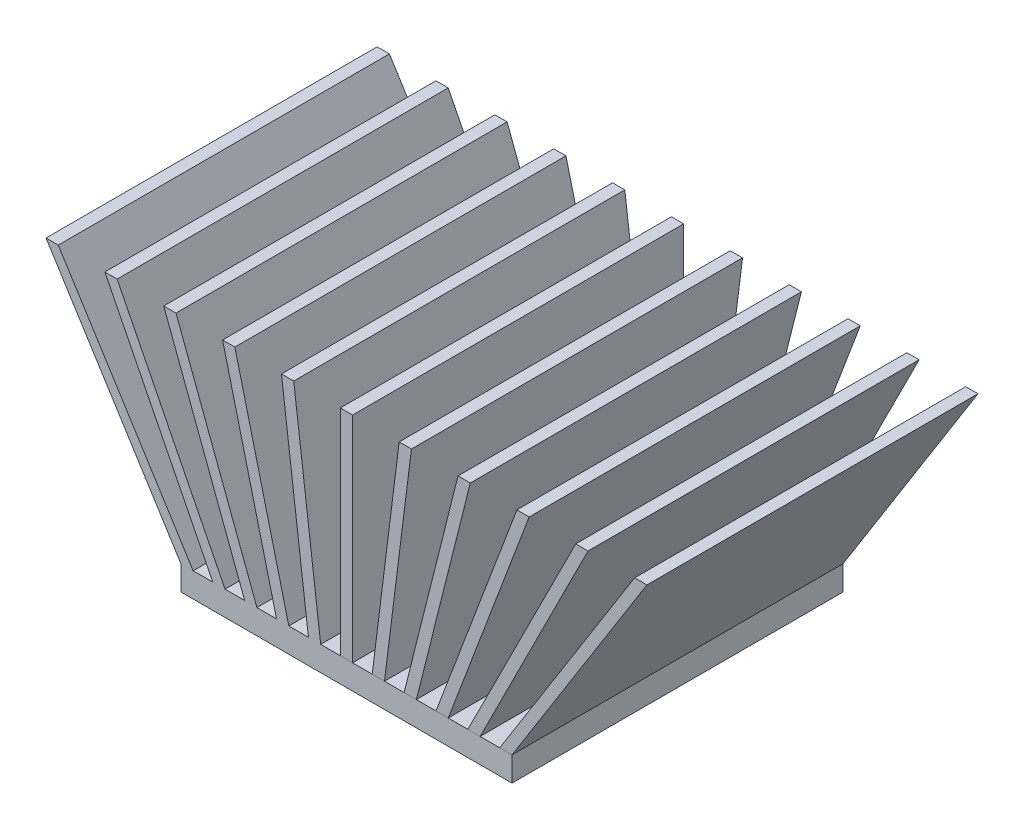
ISO-10303-21;
HEADER;
FILE_DESCRIPTION(('STEP AP214'),'2;1');
FILE_NAME('part.step','',(''),(''),'','','');
FILE_SCHEMA(('AUTOMOTIVE_DESIGN { 1 0 10303 214 1 1 1 1 }'));
ENDSEC;
DATA;
#1=APPLICATION_CONTEXT('core data for automotive mechanical design processes');
#2=APPLICATION_PROTOCOL_DEFINITION('international standard','automotive_design',2000,#1);
#3=PRODUCT_CONTEXT('',#1,'mechanical');
#4=PRODUCT('Part','Part','',(#3));
#5=PRODUCT_RELATED_PRODUCT_CATEGORY('part','',(#4));
#6=PRODUCT_DEFINITION_FORMATION('','',#4);
#7=PRODUCT_DEFINITION_CONTEXT('part definition',#1,'design');
#8=PRODUCT_DEFINITION('design','',#6,#7);
#9=PRODUCT_DEFINITION_SHAPE('','',#8);
#10=(LENGTH_UNIT() NAMED_UNIT(*) SI_UNIT(.MILLI.,.METRE.));
#11=(NAMED_UNIT(*) PLANE_ANGLE_UNIT() SI_UNIT($,.RADIAN.));
#12=(NAMED_UNIT(*) SI_UNIT($,.STERADIAN.) SOLID_ANGLE_UNIT());
#13=UNCERTAINTY_MEASURE_WITH_UNIT(LENGTH_MEASURE(1.E-05),#10,'distance_accuracy_value','');
#14=(GEOMETRIC_REPRESENTATION_CONTEXT(3) GLOBAL_UNCERTAINTY_ASSIGNED_CONTEXT((#13)) GLOBAL_UNIT_ASSIGNED_CONTEXT((#10,
#11,#12)) REPRESENTATION_CONTEXT('',''));
#15=CARTESIAN_POINT('',(0.,0.,0.));
#16=DIRECTION('',(0.,0.,1.));
#17=DIRECTION('',(1.,0.,0.));
#18=AXIS2_PLACEMENT_3D('',#15,#16,#17);
#19=CARTESIAN_POINT('',(0.,0.,0.));
#20=DIRECTION('',(0.,1.,0.));
#21=DIRECTION('',(0.,0.,1.));
#22=AXIS2_PLACEMENT_3D('',#19,#20,#21);
#23=PLANE('',#22);
#24=DIRECTION('',(-1.,0.,0.));
#25=VECTOR('',#24,1.);
#26=CARTESIAN_POINT('',(13.5,0.,-13.5));
#27=LINE('',#26,#25);
#28=CARTESIAN_POINT('',(-10.9,0.,-13.5));
#29=VERTEX_POINT('',#28);
#30=CARTESIAN_POINT('',(-12.5,0.,-13.5));
#31=VERTEX_POINT('',#30);
#32=EDGE_CURVE('E1428',#29,#31,#27,.T.);
#33=ORIENTED_EDGE('',*,*,#32,.T.);
#34=CARTESIAN_POINT('',(-12.5,0.,13.5));
#35=DIRECTION('',(0.,0.,-1.));
#36=VECTOR('',#35,1.);
#37=LINE('',#34,#36);
#38=CARTESIAN_POINT('',(-12.5,0.,13.5));
#39=VERTEX_POINT('',#38);
#40=EDGE_CURVE('E1983',#39,#31,#37,.T.);
#41=ORIENTED_EDGE('',*,*,#40,.F.);
#42=DIRECTION('',(1.,0.,0.));
#43=VECTOR('',#42,1.);
#44=CARTESIAN_POINT('',(13.5,0.,13.5));
#45=LINE('',#44,#43);
#46=CARTESIAN_POINT('',(-10.9,0.,13.5));
#47=VERTEX_POINT('',#46);
#48=EDGE_CURVE('E1657',#39,#47,#45,.T.);
#49=ORIENTED_EDGE('',*,*,#48,.T.);
#50=CARTESIAN_POINT('',(-10.9,0.,13.5));
#51=DIRECTION('',(0.,0.,-1.));
#52=VECTOR('',#51,1.);
#53=LINE('',#50,#52);
#54=EDGE_CURVE('E2228',#47,#29,#53,.T.);
#55=ORIENTED_EDGE('',*,*,#54,.T.);
#56=EDGE_LOOP('',(#33,#41,#49,#55));
#57=FACE_BOUND('',#56,.T.);
#58=ADVANCED_FACE('F1408',(#57),#23,.T.);
#59=CARTESIAN_POINT('',(13.5,0.,-13.5));
#60=VERTEX_POINT('',#59);
#61=CARTESIAN_POINT('',(-2.1,0.,-13.5));
#62=VERTEX_POINT('',#61);
#63=EDGE_CURVE('E1730',#60,#62,#27,.T.);
#64=ORIENTED_EDGE('',*,*,#63,.T.);
#65=DIRECTION('',(0.,0.,-1.));
#66=VECTOR('',#65,1.);
#67=CARTESIAN_POINT('',(-2.1,0.,0.));
#68=LINE('',#67,#66);
#69=CARTESIAN_POINT('',(-2.1,0.,13.5));
#70=VERTEX_POINT('',#69);
#71=EDGE_CURVE('E2183',#70,#62,#68,.T.);
#72=ORIENTED_EDGE('',*,*,#71,.F.);
#73=CARTESIAN_POINT('',(13.5,0.,13.5));
#74=VERTEX_POINT('',#73);
#75=EDGE_CURVE('E1689',#70,#74,#45,.T.);
#76=ORIENTED_EDGE('',*,*,#75,.T.);
#77=DIRECTION('',(0.,0.,-1.));
#78=VECTOR('',#77,1.);
#79=CARTESIAN_POINT('',(13.5,0.,13.5));
#80=LINE('',#79,#78);
#81=EDGE_CURVE('E1705',#74,#60,#80,.T.);
#82=ORIENTED_EDGE('',*,*,#81,.T.);
#83=EDGE_LOOP('',(#64,#72,#76,#82));
#84=FACE_BOUND('',#83,.T.);
#85=ADVANCED_FACE('F2192',(#84),#23,.T.);
#86=DIRECTION('',(0.,0.,1.));
#87=VECTOR('',#86,1.);
#88=CARTESIAN_POINT('',(-3.1,0.,0.));
#89=LINE('',#88,#87);
#90=CARTESIAN_POINT('',(-3.1,0.,13.5));
#91=VERTEX_POINT('',#90);
#92=CARTESIAN_POINT('',(-3.1,0.,-13.5));
#93=VERTEX_POINT('',#92);
#94=EDGE_CURVE('E1436',#91,#93,#89,.F.);
#95=ORIENTED_EDGE('',*,*,#94,.T.);
#96=CARTESIAN_POINT('',(-4.7,0.,-13.5));
#97=VERTEX_POINT('',#96);
#98=EDGE_CURVE('E1697',#93,#97,#27,.T.);
#99=ORIENTED_EDGE('',*,*,#98,.T.);
#100=DIRECTION('',(0.,0.,-1.));
#101=VECTOR('',#100,1.);
#102=CARTESIAN_POINT('',(-4.7,0.,0.));
#103=LINE('',#102,#101);
#104=CARTESIAN_POINT('',(-4.7,0.,13.5));
#105=VERTEX_POINT('',#104);
#106=EDGE_CURVE('E2150',#105,#97,#103,.T.);
#107=ORIENTED_EDGE('',*,*,#106,.F.);
#108=EDGE_CURVE('E1696',#105,#91,#45,.T.);
#109=ORIENTED_EDGE('',*,*,#108,.T.);
#110=EDGE_LOOP('',(#95,#99,#107,#109));
#111=FACE_BOUND('',#110,.T.);
#112=ADVANCED_FACE('F2194',(#111),#23,.T.);
#113=DIRECTION('',(0.,0.,1.));
#114=VECTOR('',#113,1.);
#115=CARTESIAN_POINT('',(-5.7,0.,0.));
#116=LINE('',#115,#114);
#117=CARTESIAN_POINT('',(-5.7,0.,13.5));
#118=VERTEX_POINT('',#117);
#119=CARTESIAN_POINT('',(-5.7,0.,-13.5));
#120=VERTEX_POINT('',#119);
#121=EDGE_CURVE('E1720',#118,#120,#116,.F.);
#122=ORIENTED_EDGE('',*,*,#121,.T.);
#123=CARTESIAN_POINT('',(-7.3,0.,-13.5));
#124=VERTEX_POINT('',#123);
#125=EDGE_CURVE('E1717',#120,#124,#27,.T.);
#126=ORIENTED_EDGE('',*,*,#125,.T.);
#127=DIRECTION('',(0.,0.,-1.));
#128=VECTOR('',#127,1.);
#129=CARTESIAN_POINT('',(-7.3,0.,0.));
#130=LINE('',#129,#128);
#131=CARTESIAN_POINT('',(-7.3,0.,13.5));
#132=VERTEX_POINT('',#131);
#133=EDGE_CURVE('E1734',#132,#124,#130,.T.);
#134=ORIENTED_EDGE('',*,*,#133,.F.);
#135=EDGE_CURVE('E1714',#132,#118,#45,.T.);
#136=ORIENTED_EDGE('',*,*,#135,.T.);
#137=EDGE_LOOP('',(#122,#126,#134,#136));
#138=FACE_BOUND('',#137,.T.);
#139=ADVANCED_FACE('F2203',(#138),#23,.T.);
#140=DIRECTION('',(0.,0.,1.));
#141=VECTOR('',#140,1.);
#142=CARTESIAN_POINT('',(-8.3,0.,0.));
#143=LINE('',#142,#141);
#144=CARTESIAN_POINT('',(-8.3,0.,13.5));
#145=VERTEX_POINT('',#144);
#146=CARTESIAN_POINT('',(-8.3,0.,-13.5));
#147=VERTEX_POINT('',#146);
#148=EDGE_CURVE('E1732',#145,#147,#143,.F.);
#149=ORIENTED_EDGE('',*,*,#148,.T.);
#150=CARTESIAN_POINT('',(-9.9,0.,-13.5));
#151=VERTEX_POINT('',#150);
#152=EDGE_CURVE('E1719',#147,#151,#27,.T.);
#153=ORIENTED_EDGE('',*,*,#152,.T.);
#154=CARTESIAN_POINT('',(-9.9,0.,13.5));
#155=DIRECTION('',(0.,0.,-1.));
#156=VECTOR('',#155,1.);
#157=LINE('',#154,#156);
#158=CARTESIAN_POINT('',(-9.9,0.,13.5));
#159=VERTEX_POINT('',#158);
#160=EDGE_CURVE('E1901',#159,#151,#157,.T.);
#161=ORIENTED_EDGE('',*,*,#160,.F.);
#162=EDGE_CURVE('E1709',#159,#145,#45,.T.);
#163=ORIENTED_EDGE('',*,*,#162,.T.);
#164=EDGE_LOOP('',(#149,#153,#161,#163));
#165=FACE_BOUND('',#164,.T.);
#166=ADVANCED_FACE('F1669',(#165),#23,.T.);
#167=CARTESIAN_POINT('',(-13.5,-2.,13.5));
#168=DIRECTION('',(-1.,0.,0.));
#169=DIRECTION('',(0.,0.,1.));
#170=AXIS2_PLACEMENT_3D('',#167,#168,#169);
#171=PLANE('',#170);
#172=CARTESIAN_POINT('',(-13.5,0.,-13.5));
#173=DIRECTION('',(0.,0.,1.));
#174=VECTOR('',#173,1.);
#175=LINE('',#172,#174);
#176=CARTESIAN_POINT('',(-13.5,0.,-13.5));
#177=VERTEX_POINT('',#176);
#178=CARTESIAN_POINT('',(-13.5,0.,13.5));
#179=VERTEX_POINT('',#178);
#180=EDGE_CURVE('E1578',#177,#179,#175,.T.);
#181=ORIENTED_EDGE('',*,*,#180,.F.);
#182=DIRECTION('',(0.,1.,0.));
#183=VECTOR('',#182,1.);
#184=CARTESIAN_POINT('',(-13.5,-2.,-13.5));
#185=LINE('',#184,#183);
#186=CARTESIAN_POINT('',(-13.5,-2.,-13.5));
#187=VERTEX_POINT('',#186);
#188=EDGE_CURVE('E13',#187,#177,#185,.T.);
#189=ORIENTED_EDGE('',*,*,#188,.F.);
#190=DIRECTION('',(0.,0.,1.));
#191=VECTOR('',#190,1.);
#192=CARTESIAN_POINT('',(-13.5,-2.,13.5));
#193=LINE('',#192,#191);
#194=CARTESIAN_POINT('',(-13.5,-2.,13.5));
#195=VERTEX_POINT('',#194);
#196=EDGE_CURVE('E1952',#187,#195,#193,.T.);
#197=ORIENTED_EDGE('',*,*,#196,.T.);
#198=DIRECTION('',(0.,1.,0.));
#199=VECTOR('',#198,1.);
#200=CARTESIAN_POINT('',(-13.5,-2.,13.5));
#201=LINE('',#200,#199);
#202=EDGE_CURVE('E1963',#195,#179,#201,.T.);
#203=ORIENTED_EDGE('',*,*,#202,.T.);
#204=EDGE_LOOP('',(#181,#189,#197,#203));
#205=FACE_BOUND('',#204,.T.);
#206=ADVANCED_FACE('F1410',(#205),#171,.T.);
#207=CARTESIAN_POINT('',(13.5,-2.,-13.5));
#208=DIRECTION('',(0.,0.,-1.));
#209=DIRECTION('',(-1.,0.,0.));
#210=AXIS2_PLACEMENT_3D('',#207,#208,#209);
#211=PLANE('',#210);
#212=ORIENTED_EDGE('',*,*,#63,.F.);
#213=DIRECTION('',(0.,1.,0.));
#214=VECTOR('',#213,1.);
#215=CARTESIAN_POINT('',(13.5,-2.,-13.5));
#216=LINE('',#215,#214);
#217=CARTESIAN_POINT('',(13.5,-2.,-13.5));
#218=VERTEX_POINT('',#217);
#219=EDGE_CURVE('E1420',#218,#60,#216,.T.);
#220=ORIENTED_EDGE('',*,*,#219,.F.);
#221=DIRECTION('',(-1.,0.,0.));
#222=VECTOR('',#221,1.);
#223=CARTESIAN_POINT('',(13.5,-2.,-13.5));
#224=LINE('',#223,#222);
#225=EDGE_CURVE('E1703',#218,#187,#224,.T.);
#226=ORIENTED_EDGE('',*,*,#225,.T.);
#227=ORIENTED_EDGE('',*,*,#188,.T.);
#228=DIRECTION('',(-0.532171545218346,0.846636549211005,0.));
#229=VECTOR('',#228,1.);
#230=CARTESIAN_POINT('',(-13.5,0.,-13.5));
#231=LINE('',#230,#229);
#232=CARTESIAN_POINT('',(-24.5,17.5,-13.5));
#233=VERTEX_POINT('',#232);
#234=EDGE_CURVE('E1583',#177,#233,#231,.T.);
#235=ORIENTED_EDGE('',*,*,#234,.T.);
#236=CARTESIAN_POINT('',(-24.5,17.5,-13.5));
#237=DIRECTION('',(1.,0.,0.));
#238=VECTOR('',#237,1.);
#239=LINE('',#236,#238);
#240=CARTESIAN_POINT('',(-23.5,17.5,-13.5));
#241=VERTEX_POINT('',#240);
#242=EDGE_CURVE('E1593',#233,#241,#239,.T.);
#243=ORIENTED_EDGE('',*,*,#242,.T.);
#244=DIRECTION('',(-0.532171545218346,0.846636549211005,0.));
#245=VECTOR('',#244,1.);
#246=CARTESIAN_POINT('',(-12.5,0.,-13.5));
#247=LINE('',#246,#245);
#248=EDGE_CURVE('E1998',#31,#241,#247,.T.);
#249=ORIENTED_EDGE('',*,*,#248,.F.);
#250=ORIENTED_EDGE('',*,*,#32,.F.);
#251=DIRECTION('',(-0.449254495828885,0.893403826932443,0.));
#252=VECTOR('',#251,1.);
#253=CARTESIAN_POINT('',(-10.9,0.,-13.5));
#254=LINE('',#253,#252);
#255=CARTESIAN_POINT('',(-19.7,17.5,-13.5));
#256=VERTEX_POINT('',#255);
#257=EDGE_CURVE('E1946',#29,#256,#254,.T.);
#258=ORIENTED_EDGE('',*,*,#257,.T.);
#259=CARTESIAN_POINT('',(-19.7,17.5,-13.5));
#260=DIRECTION('',(1.,0.,0.));
#261=VECTOR('',#260,1.);
#262=LINE('',#259,#261);
#263=CARTESIAN_POINT('',(-18.7,17.5,-13.5));
#264=VERTEX_POINT('',#263);
#265=EDGE_CURVE('E2227',#256,#264,#262,.T.);
#266=ORIENTED_EDGE('',*,*,#265,.T.);
#267=DIRECTION('',(-0.449254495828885,0.893403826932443,0.));
#268=VECTOR('',#267,1.);
#269=CARTESIAN_POINT('',(-9.9,0.,-13.5));
#270=LINE('',#269,#268);
#271=EDGE_CURVE('E1942',#151,#264,#270,.T.);
#272=ORIENTED_EDGE('',*,*,#271,.F.);
#273=ORIENTED_EDGE('',*,*,#152,.F.);
#274=DIRECTION('',(-0.352880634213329,0.935668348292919,0.));
#275=VECTOR('',#274,1.);
#276=CARTESIAN_POINT('',(-8.3,0.,-13.5));
#277=LINE('',#276,#275);
#278=CARTESIAN_POINT('',(-14.9,17.5,-13.5));
#279=VERTEX_POINT('',#278);
#280=EDGE_CURVE('E2212',#147,#279,#277,.T.);
#281=ORIENTED_EDGE('',*,*,#280,.T.);
#282=CARTESIAN_POINT('',(-14.9,17.5,-13.5));
#283=DIRECTION('',(1.,0.,0.));
#284=VECTOR('',#283,1.);
#285=LINE('',#282,#284);
#286=CARTESIAN_POINT('',(-13.9,17.5,-13.5));
#287=VERTEX_POINT('',#286);
#288=EDGE_CURVE('E1757',#279,#287,#285,.T.);
#289=ORIENTED_EDGE('',*,*,#288,.T.);
#290=DIRECTION('',(-0.352880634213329,0.935668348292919,0.));
#291=VECTOR('',#290,1.);
#292=CARTESIAN_POINT('',(-7.3,0.,-13.5));
#293=LINE('',#292,#291);
#294=EDGE_CURVE('E2214',#124,#287,#293,.T.);
#295=ORIENTED_EDGE('',*,*,#294,.F.);
#296=ORIENTED_EDGE('',*,*,#125,.F.);
#297=DIRECTION('',(-0.243839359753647,0.969815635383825,0.));
#298=VECTOR('',#297,1.);
#299=CARTESIAN_POINT('',(-5.7,0.,-13.5));
#300=LINE('',#299,#298);
#301=CARTESIAN_POINT('',(-10.1,17.5,-13.5));
#302=VERTEX_POINT('',#301);
#303=EDGE_CURVE('E1756',#120,#302,#300,.T.);
#304=ORIENTED_EDGE('',*,*,#303,.T.);
#305=CARTESIAN_POINT('',(-10.1,17.5,-13.5));
#306=DIRECTION('',(1.,0.,0.));
#307=VECTOR('',#306,1.);
#308=LINE('',#305,#307);
#309=CARTESIAN_POINT('',(-9.1,17.5,-13.5));
#310=VERTEX_POINT('',#309);
#311=EDGE_CURVE('E2168',#302,#310,#308,.T.);
#312=ORIENTED_EDGE('',*,*,#311,.T.);
#313=DIRECTION('',(-0.243839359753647,0.969815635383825,0.));
#314=VECTOR('',#313,1.);
#315=CARTESIAN_POINT('',(-4.7,0.,-13.5));
#316=LINE('',#315,#314);
#317=EDGE_CURVE('E1758',#97,#310,#316,.T.);
#318=ORIENTED_EDGE('',*,*,#317,.F.);
#319=ORIENTED_EDGE('',*,*,#98,.F.);
#320=DIRECTION('',(-0.124732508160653,0.992190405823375,0.));
#321=VECTOR('',#320,1.);
#322=CARTESIAN_POINT('',(-3.1,0.,-13.5));
#323=LINE('',#322,#321);
#324=CARTESIAN_POINT('',(-5.3,17.5,-13.5));
#325=VERTEX_POINT('',#324);
#326=EDGE_CURVE('E2074',#93,#325,#323,.T.);
#327=ORIENTED_EDGE('',*,*,#326,.T.);
#328=CARTESIAN_POINT('',(-5.3,17.5,-13.5));
#329=DIRECTION('',(1.,0.,0.));
#330=VECTOR('',#329,1.);
#331=LINE('',#328,#330);
#332=CARTESIAN_POINT('',(-4.3,17.5,-13.5));
#333=VERTEX_POINT('',#332);
#334=EDGE_CURVE('E1652',#325,#333,#331,.T.);
#335=ORIENTED_EDGE('',*,*,#334,.T.);
#336=DIRECTION('',(-0.124732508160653,0.992190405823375,0.));
#337=VECTOR('',#336,1.);
#338=CARTESIAN_POINT('',(-2.1,0.,-13.5));
#339=LINE('',#338,#337);
#340=EDGE_CURVE('E2169',#62,#333,#339,.T.);
#341=ORIENTED_EDGE('',*,*,#340,.F.);
#342=EDGE_LOOP('',(#212,#220,#226,#227,#235,#243,#249,#250,#258,#266,#272,#273,#281,#289,#295,
#296,#304,#312,#318,#319,#327,#335,#341));
#343=FACE_BOUND('',#342,.T.);
#344=ADVANCED_FACE('F1660',(#343),#211,.T.);
#345=CARTESIAN_POINT('',(13.5,-2.,13.5));
#346=DIRECTION('',(1.,0.,0.));
#347=DIRECTION('',(0.,0.,-1.));
#348=AXIS2_PLACEMENT_3D('',#345,#346,#347);
#349=PLANE('',#348);
#350=ORIENTED_EDGE('',*,*,#81,.F.);
#351=DIRECTION('',(0.,1.,0.));
#352=VECTOR('',#351,1.);
#353=CARTESIAN_POINT('',(13.5,-2.,13.5));
#354=LINE('',#353,#352);
#355=CARTESIAN_POINT('',(13.5,-2.,13.5));
#356=VERTEX_POINT('',#355);
#357=EDGE_CURVE('E1964',#356,#74,#354,.T.);
#358=ORIENTED_EDGE('',*,*,#357,.F.);
#359=DIRECTION('',(0.,0.,-1.));
#360=VECTOR('',#359,1.);
#361=CARTESIAN_POINT('',(13.5,-2.,13.5));
#362=LINE('',#361,#360);
#363=EDGE_CURVE('E1957',#356,#218,#362,.T.);
#364=ORIENTED_EDGE('',*,*,#363,.T.);
#365=ORIENTED_EDGE('',*,*,#219,.T.);
#366=EDGE_LOOP('',(#350,#358,#364,#365));
#367=FACE_BOUND('',#366,.T.);
#368=ADVANCED_FACE('F1615',(#367),#349,.T.);
#369=CARTESIAN_POINT('',(13.5,-2.,13.5));
#370=DIRECTION('',(0.,0.,1.));
#371=DIRECTION('',(1.,0.,0.));
#372=AXIS2_PLACEMENT_3D('',#369,#370,#371);
#373=PLANE('',#372);
#374=ORIENTED_EDGE('',*,*,#48,.F.);
#375=DIRECTION('',(-0.532171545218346,0.846636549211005,0.));
#376=VECTOR('',#375,1.);
#377=CARTESIAN_POINT('',(-12.5,0.,13.5));
#378=LINE('',#377,#376);
#379=CARTESIAN_POINT('',(-23.5,17.5,13.5));
#380=VERTEX_POINT('',#379);
#381=EDGE_CURVE('E1582',#39,#380,#378,.T.);
#382=ORIENTED_EDGE('',*,*,#381,.T.);
#383=CARTESIAN_POINT('',(-24.5,17.5,13.5));
#384=DIRECTION('',(1.,0.,0.));
#385=VECTOR('',#384,1.);
#386=LINE('',#383,#385);
#387=CARTESIAN_POINT('',(-24.5,17.5,13.5));
#388=VERTEX_POINT('',#387);
#389=EDGE_CURVE('E1590',#388,#380,#386,.T.);
#390=ORIENTED_EDGE('',*,*,#389,.F.);
#391=DIRECTION('',(-0.532171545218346,0.846636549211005,0.));
#392=VECTOR('',#391,1.);
#393=CARTESIAN_POINT('',(-13.5,0.,13.5));
#394=LINE('',#393,#392);
#395=EDGE_CURVE('E1570',#179,#388,#394,.T.);
#396=ORIENTED_EDGE('',*,*,#395,.F.);
#397=ORIENTED_EDGE('',*,*,#202,.F.);
#398=DIRECTION('',(1.,0.,0.));
#399=VECTOR('',#398,1.);
#400=CARTESIAN_POINT('',(13.5,-2.,13.5));
#401=LINE('',#400,#399);
#402=EDGE_CURVE('E1955',#195,#356,#401,.T.);
#403=ORIENTED_EDGE('',*,*,#402,.T.);
#404=ORIENTED_EDGE('',*,*,#357,.T.);
#405=ORIENTED_EDGE('',*,*,#75,.F.);
#406=DIRECTION('',(-0.124732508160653,0.992190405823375,0.));
#407=VECTOR('',#406,1.);
#408=CARTESIAN_POINT('',(-2.1,0.,13.5));
#409=LINE('',#408,#407);
#410=CARTESIAN_POINT('',(-4.3,17.5,13.5));
#411=VERTEX_POINT('',#410);
#412=EDGE_CURVE('E2170',#70,#411,#409,.T.);
#413=ORIENTED_EDGE('',*,*,#412,.T.);
#414=CARTESIAN_POINT('',(-5.3,17.5,13.5));
#415=DIRECTION('',(1.,0.,0.));
#416=VECTOR('',#415,1.);
#417=LINE('',#414,#416);
#418=CARTESIAN_POINT('',(-5.3,17.5,13.5));
#419=VERTEX_POINT('',#418);
#420=EDGE_CURVE('E2002',#419,#411,#417,.T.);
#421=ORIENTED_EDGE('',*,*,#420,.F.);
#422=DIRECTION('',(-0.124732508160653,0.992190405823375,0.));
#423=VECTOR('',#422,1.);
#424=CARTESIAN_POINT('',(-3.1,0.,13.5));
#425=LINE('',#424,#423);
#426=EDGE_CURVE('E2173',#91,#419,#425,.T.);
#427=ORIENTED_EDGE('',*,*,#426,.F.);
#428=ORIENTED_EDGE('',*,*,#108,.F.);
#429=DIRECTION('',(-0.243839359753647,0.969815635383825,0.));
#430=VECTOR('',#429,1.);
#431=CARTESIAN_POINT('',(-4.7,0.,13.5));
#432=LINE('',#431,#430);
#433=CARTESIAN_POINT('',(-9.1,17.5,13.5));
#434=VERTEX_POINT('',#433);
#435=EDGE_CURVE('E1763',#105,#434,#432,.T.);
#436=ORIENTED_EDGE('',*,*,#435,.T.);
#437=CARTESIAN_POINT('',(-10.1,17.5,13.5));
#438=DIRECTION('',(1.,0.,0.));
#439=VECTOR('',#438,1.);
#440=LINE('',#437,#439);
#441=CARTESIAN_POINT('',(-10.1,17.5,13.5));
#442=VERTEX_POINT('',#441);
#443=EDGE_CURVE('E2157',#442,#434,#440,.T.);
#444=ORIENTED_EDGE('',*,*,#443,.F.);
#445=DIRECTION('',(-0.243839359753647,0.969815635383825,0.));
#446=VECTOR('',#445,1.);
#447=CARTESIAN_POINT('',(-5.7,0.,13.5));
#448=LINE('',#447,#446);
#449=EDGE_CURVE('E2143',#118,#442,#448,.T.);
#450=ORIENTED_EDGE('',*,*,#449,.F.);
#451=ORIENTED_EDGE('',*,*,#135,.F.);
#452=DIRECTION('',(-0.352880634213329,0.935668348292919,0.));
#453=VECTOR('',#452,1.);
#454=CARTESIAN_POINT('',(-7.3,0.,13.5));
#455=LINE('',#454,#453);
#456=CARTESIAN_POINT('',(-13.9,17.5,13.5));
#457=VERTEX_POINT('',#456);
#458=EDGE_CURVE('E1740',#132,#457,#455,.T.);
#459=ORIENTED_EDGE('',*,*,#458,.T.);
#460=CARTESIAN_POINT('',(-14.9,17.5,13.5));
#461=DIRECTION('',(1.,0.,0.));
#462=VECTOR('',#461,1.);
#463=LINE('',#460,#462);
#464=CARTESIAN_POINT('',(-14.9,17.5,13.5));
#465=VERTEX_POINT('',#464);
#466=EDGE_CURVE('E1745',#465,#457,#463,.T.);
#467=ORIENTED_EDGE('',*,*,#466,.F.);
#468=DIRECTION('',(-0.352880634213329,0.935668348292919,0.));
#469=VECTOR('',#468,1.);
#470=CARTESIAN_POINT('',(-8.3,0.,13.5));
#471=LINE('',#470,#469);
#472=EDGE_CURVE('E1747',#145,#465,#471,.T.);
#473=ORIENTED_EDGE('',*,*,#472,.F.);
#474=ORIENTED_EDGE('',*,*,#162,.F.);
#475=DIRECTION('',(-0.449254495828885,0.893403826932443,0.));
#476=VECTOR('',#475,1.);
#477=CARTESIAN_POINT('',(-9.9,0.,13.5));
#478=LINE('',#477,#476);
#479=CARTESIAN_POINT('',(-18.7,17.5,13.5));
#480=VERTEX_POINT('',#479);
#481=EDGE_CURVE('E1938',#159,#480,#478,.T.);
#482=ORIENTED_EDGE('',*,*,#481,.T.);
#483=CARTESIAN_POINT('',(-19.7,17.5,13.5));
#484=DIRECTION('',(1.,0.,0.));
#485=VECTOR('',#484,1.);
#486=LINE('',#483,#485);
#487=CARTESIAN_POINT('',(-19.7,17.5,13.5));
#488=VERTEX_POINT('',#487);
#489=EDGE_CURVE('E2216',#488,#480,#486,.T.);
#490=ORIENTED_EDGE('',*,*,#489,.F.);
#491=DIRECTION('',(-0.449254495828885,0.893403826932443,0.));
#492=VECTOR('',#491,1.);
#493=CARTESIAN_POINT('',(-10.9,0.,13.5));
#494=LINE('',#493,#492);
#495=EDGE_CURVE('E1931',#47,#488,#494,.T.);
#496=ORIENTED_EDGE('',*,*,#495,.F.);
#497=EDGE_LOOP('',(#374,#382,#390,#396,#397,#403,#404,#405,#413,#421,#427,#428,#436,#444,#450,
#451,#459,#467,#473,#474,#482,#490,#496));
#498=FACE_BOUND('',#497,.T.);
#499=ADVANCED_FACE('F1598',(#498),#373,.T.);
#500=CARTESIAN_POINT('',(0.,-2.,0.));
#501=DIRECTION('',(0.,1.,0.));
#502=DIRECTION('',(0.,0.,1.));
#503=AXIS2_PLACEMENT_3D('',#500,#501,#502);
#504=PLANE('',#503);
#505=ORIENTED_EDGE('',*,*,#196,.F.);
#506=ORIENTED_EDGE('',*,*,#225,.F.);
#507=ORIENTED_EDGE('',*,*,#363,.F.);
#508=ORIENTED_EDGE('',*,*,#402,.F.);
#509=EDGE_LOOP('',(#505,#506,#507,#508));
#510=FACE_BOUND('',#509,.T.);
#511=ADVANCED_FACE('F1614',(#510),#504,.F.);
#512=CARTESIAN_POINT('',(0.,17.5,0.));
#513=DIRECTION('',(0.,1.,0.));
#514=DIRECTION('',(0.,0.,1.));
#515=AXIS2_PLACEMENT_3D('',#512,#513,#514);
#516=PLANE('',#515);
#517=ORIENTED_EDGE('',*,*,#489,.T.);
#518=CARTESIAN_POINT('',(-18.7,17.5,-13.5));
#519=DIRECTION('',(0.,0.,1.));
#520=VECTOR('',#519,1.);
#521=LINE('',#518,#520);
#522=EDGE_CURVE('E1879',#264,#480,#521,.T.);
#523=ORIENTED_EDGE('',*,*,#522,.F.);
#524=ORIENTED_EDGE('',*,*,#265,.F.);
#525=CARTESIAN_POINT('',(-19.7,17.5,-13.5));
#526=DIRECTION('',(0.,0.,1.));
#527=VECTOR('',#526,1.);
#528=LINE('',#525,#527);
#529=EDGE_CURVE('E1914',#256,#488,#528,.T.);
#530=ORIENTED_EDGE('',*,*,#529,.T.);
#531=EDGE_LOOP('',(#517,#523,#524,#530));
#532=FACE_BOUND('',#531,.T.);
#533=ADVANCED_FACE('F1845',(#532),#516,.T.);
#534=CARTESIAN_POINT('',(-7.90188693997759,-3.9735202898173,0.));
#535=DIRECTION('',(-0.893403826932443,-0.449254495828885,0.));
#536=DIRECTION('',(-0.449254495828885,0.893403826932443,0.));
#537=AXIS2_PLACEMENT_3D('',#534,#535,#536);
#538=PLANE('',#537);
#539=ORIENTED_EDGE('',*,*,#481,.F.);
#540=ORIENTED_EDGE('',*,*,#160,.T.);
#541=ORIENTED_EDGE('',*,*,#271,.T.);
#542=ORIENTED_EDGE('',*,*,#522,.T.);
#543=EDGE_LOOP('',(#539,#540,#541,#542));
#544=FACE_BOUND('',#543,.T.);
#545=ADVANCED_FACE('F1849',(#544),#538,.F.);
#546=CARTESIAN_POINT('',(-8.70005733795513,-4.37488597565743,0.));
#547=DIRECTION('',(-0.893403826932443,-0.449254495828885,0.));
#548=DIRECTION('',(-0.449254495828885,0.893403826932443,0.));
#549=AXIS2_PLACEMENT_3D('',#546,#547,#548);
#550=PLANE('',#549);
#551=ORIENTED_EDGE('',*,*,#257,.F.);
#552=ORIENTED_EDGE('',*,*,#54,.F.);
#553=ORIENTED_EDGE('',*,*,#495,.T.);
#554=ORIENTED_EDGE('',*,*,#529,.F.);
#555=EDGE_LOOP('',(#551,#552,#553,#554));
#556=FACE_BOUND('',#555,.T.);
#557=ADVANCED_FACE('F1786',(#556),#550,.T.);
#558=CARTESIAN_POINT('',(0.,17.5,0.));
#559=DIRECTION('',(0.,1.,0.));
#560=DIRECTION('',(0.,0.,1.));
#561=AXIS2_PLACEMENT_3D('',#558,#559,#560);
#562=PLANE('',#561);
#563=ORIENTED_EDGE('',*,*,#466,.T.);
#564=CARTESIAN_POINT('',(-13.9,17.5,-13.5));
#565=DIRECTION('',(0.,0.,1.));
#566=VECTOR('',#565,1.);
#567=LINE('',#564,#566);
#568=EDGE_CURVE('E1735',#287,#457,#567,.T.);
#569=ORIENTED_EDGE('',*,*,#568,.F.);
#570=ORIENTED_EDGE('',*,*,#288,.F.);
#571=CARTESIAN_POINT('',(-14.9,17.5,-13.5));
#572=DIRECTION('',(0.,0.,1.));
#573=VECTOR('',#572,1.);
#574=LINE('',#571,#573);
#575=EDGE_CURVE('E1755',#279,#465,#574,.T.);
#576=ORIENTED_EDGE('',*,*,#575,.T.);
#577=EDGE_LOOP('',(#563,#569,#570,#576));
#578=FACE_BOUND('',#577,.T.);
#579=ADVANCED_FACE('F1775',(#578),#562,.T.);
#580=CARTESIAN_POINT('',(-6.39096938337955,-2.41030845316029,0.));
#581=DIRECTION('',(-0.935668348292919,-0.352880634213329,0.));
#582=DIRECTION('',(-0.352880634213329,0.935668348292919,0.));
#583=AXIS2_PLACEMENT_3D('',#580,#581,#582);
#584=PLANE('',#583);
#585=ORIENTED_EDGE('',*,*,#458,.F.);
#586=ORIENTED_EDGE('',*,*,#133,.T.);
#587=ORIENTED_EDGE('',*,*,#294,.T.);
#588=ORIENTED_EDGE('',*,*,#568,.T.);
#589=EDGE_LOOP('',(#585,#586,#587,#588));
#590=FACE_BOUND('',#589,.T.);
#591=ADVANCED_FACE('F1785',(#590),#584,.F.);
#592=CARTESIAN_POINT('',(-7.26644464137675,-2.74048769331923,0.));
#593=DIRECTION('',(-0.935668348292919,-0.352880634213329,0.));
#594=DIRECTION('',(-0.352880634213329,0.935668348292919,0.));
#595=AXIS2_PLACEMENT_3D('',#592,#593,#594);
#596=PLANE('',#595);
#597=ORIENTED_EDGE('',*,*,#280,.F.);
#598=ORIENTED_EDGE('',*,*,#148,.F.);
#599=ORIENTED_EDGE('',*,*,#472,.T.);
#600=ORIENTED_EDGE('',*,*,#575,.F.);
#601=EDGE_LOOP('',(#597,#598,#599,#600));
#602=FACE_BOUND('',#601,.T.);
#603=ADVANCED_FACE('F1835',(#602),#596,.T.);
#604=CARTESIAN_POINT('',(0.,17.5,0.));
#605=DIRECTION('',(0.,1.,0.));
#606=DIRECTION('',(0.,0.,1.));
#607=AXIS2_PLACEMENT_3D('',#604,#605,#606);
#608=PLANE('',#607);
#609=ORIENTED_EDGE('',*,*,#443,.T.);
#610=CARTESIAN_POINT('',(-9.1,17.5,-13.5));
#611=DIRECTION('',(0.,0.,1.));
#612=VECTOR('',#611,1.);
#613=LINE('',#610,#612);
#614=EDGE_CURVE('E2116',#310,#434,#613,.T.);
#615=ORIENTED_EDGE('',*,*,#614,.F.);
#616=ORIENTED_EDGE('',*,*,#311,.F.);
#617=CARTESIAN_POINT('',(-10.1,17.5,-13.5));
#618=DIRECTION('',(0.,0.,1.));
#619=VECTOR('',#618,1.);
#620=LINE('',#617,#619);
#621=EDGE_CURVE('E2139',#302,#442,#620,.T.);
#622=ORIENTED_EDGE('',*,*,#621,.T.);
#623=EDGE_LOOP('',(#609,#615,#616,#622));
#624=FACE_BOUND('',#623,.T.);
#625=ADVANCED_FACE('F1844',(#624),#608,.T.);
#626=CARTESIAN_POINT('',(-4.42054912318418,-1.11145235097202,0.));
#627=DIRECTION('',(-0.969815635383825,-0.243839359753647,0.));
#628=DIRECTION('',(-0.243839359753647,0.969815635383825,0.));
#629=AXIS2_PLACEMENT_3D('',#626,#627,#628);
#630=PLANE('',#629);
#631=ORIENTED_EDGE('',*,*,#435,.F.);
#632=ORIENTED_EDGE('',*,*,#106,.T.);
#633=ORIENTED_EDGE('',*,*,#317,.T.);
#634=ORIENTED_EDGE('',*,*,#614,.T.);
#635=EDGE_LOOP('',(#631,#632,#633,#634));
#636=FACE_BOUND('',#635,.T.);
#637=ADVANCED_FACE('F2087',(#636),#630,.F.);
#638=CARTESIAN_POINT('',(-5.36109148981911,-1.34793157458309,0.));
#639=DIRECTION('',(-0.969815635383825,-0.243839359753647,0.));
#640=DIRECTION('',(-0.243839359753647,0.969815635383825,0.));
#641=AXIS2_PLACEMENT_3D('',#638,#639,#640);
#642=PLANE('',#641);
#643=ORIENTED_EDGE('',*,*,#303,.F.);
#644=ORIENTED_EDGE('',*,*,#121,.F.);
#645=ORIENTED_EDGE('',*,*,#449,.T.);
#646=ORIENTED_EDGE('',*,*,#621,.F.);
#647=EDGE_LOOP('',(#643,#644,#645,#646));
#648=FACE_BOUND('',#647,.T.);
#649=ADVANCED_FACE('F1787',(#648),#642,.T.);
#650=CARTESIAN_POINT('',(0.,17.5,0.));
#651=DIRECTION('',(0.,1.,0.));
#652=DIRECTION('',(0.,0.,1.));
#653=AXIS2_PLACEMENT_3D('',#650,#651,#652);
#654=PLANE('',#653);
#655=ORIENTED_EDGE('',*,*,#420,.T.);
#656=CARTESIAN_POINT('',(-4.3,17.5,-13.5));
#657=DIRECTION('',(0.,0.,1.));
#658=VECTOR('',#657,1.);
#659=LINE('',#656,#658);
#660=EDGE_CURVE('E2046',#333,#411,#659,.T.);
#661=ORIENTED_EDGE('',*,*,#660,.F.);
#662=ORIENTED_EDGE('',*,*,#334,.F.);
#663=CARTESIAN_POINT('',(-5.3,17.5,-13.5));
#664=DIRECTION('',(0.,0.,1.));
#665=VECTOR('',#664,1.);
#666=LINE('',#663,#665);
#667=EDGE_CURVE('E2059',#325,#419,#666,.T.);
#668=ORIENTED_EDGE('',*,*,#667,.T.);
#669=EDGE_LOOP('',(#655,#661,#662,#668));
#670=FACE_BOUND('',#669,.T.);
#671=ADVANCED_FACE('F2014',(#670),#654,.T.);
#672=CARTESIAN_POINT('',(-3.05176958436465,-0.383651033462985,0.));
#673=DIRECTION('',(-0.992190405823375,-0.124732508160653,0.));
#674=DIRECTION('',(-0.124732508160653,0.992190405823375,0.));
#675=AXIS2_PLACEMENT_3D('',#672,#673,#674);
#676=PLANE('',#675);
#677=ORIENTED_EDGE('',*,*,#326,.F.);
#678=ORIENTED_EDGE('',*,*,#94,.F.);
#679=ORIENTED_EDGE('',*,*,#426,.T.);
#680=ORIENTED_EDGE('',*,*,#667,.F.);
#681=EDGE_LOOP('',(#677,#678,#679,#680));
#682=FACE_BOUND('',#681,.T.);
#683=ADVANCED_FACE('F2023',(#682),#676,.T.);
#684=CARTESIAN_POINT('',(-2.0673277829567,-0.259892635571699,0.));
#685=DIRECTION('',(-0.992190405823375,-0.124732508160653,0.));
#686=DIRECTION('',(-0.124732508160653,0.992190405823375,0.));
#687=AXIS2_PLACEMENT_3D('',#684,#685,#686);
#688=PLANE('',#687);
#689=ORIENTED_EDGE('',*,*,#412,.F.);
#690=ORIENTED_EDGE('',*,*,#71,.T.);
#691=ORIENTED_EDGE('',*,*,#340,.T.);
#692=ORIENTED_EDGE('',*,*,#660,.T.);
#693=EDGE_LOOP('',(#689,#690,#691,#692));
#694=FACE_BOUND('',#693,.T.);
#695=ADVANCED_FACE('F2076',(#694),#688,.F.);
#696=CARTESIAN_POINT('',(0.,17.5,0.));
#697=DIRECTION('',(0.,1.,0.));
#698=DIRECTION('',(0.,0.,1.));
#699=AXIS2_PLACEMENT_3D('',#696,#697,#698);
#700=PLANE('',#699);
#701=ORIENTED_EDGE('',*,*,#389,.T.);
#702=CARTESIAN_POINT('',(-23.5,17.5,-13.5));
#703=DIRECTION('',(0.,0.,1.));
#704=VECTOR('',#703,1.);
#705=LINE('',#702,#704);
#706=EDGE_CURVE('E1986',#241,#380,#705,.T.);
#707=ORIENTED_EDGE('',*,*,#706,.F.);
#708=ORIENTED_EDGE('',*,*,#242,.F.);
#709=CARTESIAN_POINT('',(-24.5,17.5,-13.5));
#710=DIRECTION('',(0.,0.,1.));
#711=VECTOR('',#710,1.);
#712=LINE('',#709,#711);
#713=EDGE_CURVE('E1574',#233,#388,#712,.T.);
#714=ORIENTED_EDGE('',*,*,#713,.T.);
#715=EDGE_LOOP('',(#701,#707,#708,#714));
#716=FACE_BOUND('',#715,.T.);
#717=ADVANCED_FACE('F1588',(#716),#700,.T.);
#718=CARTESIAN_POINT('',(-9.6767115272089,-6.0825043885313,0.));
#719=DIRECTION('',(-0.846636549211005,-0.532171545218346,0.));
#720=DIRECTION('',(-0.532171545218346,0.846636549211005,0.));
#721=AXIS2_PLACEMENT_3D('',#718,#719,#720);
#722=PLANE('',#721);
#723=ORIENTED_EDGE('',*,*,#234,.F.);
#724=ORIENTED_EDGE('',*,*,#180,.T.);
#725=ORIENTED_EDGE('',*,*,#395,.T.);
#726=ORIENTED_EDGE('',*,*,#713,.F.);
#727=EDGE_LOOP('',(#723,#724,#725,#726));
#728=FACE_BOUND('',#727,.T.);
#729=ADVANCED_FACE('F1573',(#728),#722,.T.);
#730=CARTESIAN_POINT('',(-8.95991808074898,-5.63194850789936,0.));
#731=DIRECTION('',(-0.846636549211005,-0.532171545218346,0.));
#732=DIRECTION('',(-0.532171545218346,0.846636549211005,0.));
#733=AXIS2_PLACEMENT_3D('',#730,#731,#732);
#734=PLANE('',#733);
#735=ORIENTED_EDGE('',*,*,#381,.F.);
#736=ORIENTED_EDGE('',*,*,#40,.T.);
#737=ORIENTED_EDGE('',*,*,#248,.T.);
#738=ORIENTED_EDGE('',*,*,#706,.T.);
#739=EDGE_LOOP('',(#735,#736,#737,#738));
#740=FACE_BOUND('',#739,.T.);
#741=ADVANCED_FACE('F2024',(#740),#734,.F.);
#742=CLOSED_SHELL('',(#58,#85,#112,#139,#166,#206,#344,#368,#499,#511,#533,#545,#557,#579,#591,
#603,#625,#637,#649,#671,#683,#695,#717,#729,#741));
#743=MANIFOLD_SOLID_BREP('B2',#742);
#744=CARTESIAN_POINT('',(0.,17.5,0.));
#745=DIRECTION('',(0.,1.,0.));
#746=DIRECTION('',(0.,0.,1.));
#747=AXIS2_PLACEMENT_3D('',#744,#745,#746);
#748=PLANE('',#747);
#749=DIRECTION('',(0.,0.,-1.));
#750=VECTOR('',#749,1.);
#751=CARTESIAN_POINT('',(-0.5,17.5,0.));
#752=LINE('',#751,#750);
#753=CARTESIAN_POINT('',(-0.5,17.5,13.5));
#754=VERTEX_POINT('',#753);
#755=CARTESIAN_POINT('',(-0.5,17.5,-13.5));
#756=VERTEX_POINT('',#755);
#757=EDGE_CURVE('E2664',#754,#756,#752,.T.);
#758=ORIENTED_EDGE('',*,*,#757,.F.);
#759=DIRECTION('',(1.,0.,0.));
#760=VECTOR('',#759,1.);
#761=CARTESIAN_POINT('',(0.,17.5,13.5));
#762=LINE('',#761,#760);
#763=CARTESIAN_POINT('',(0.5,17.5,13.5));
#764=VERTEX_POINT('',#763);
#765=EDGE_CURVE('E2682',#754,#764,#762,.T.);
#766=ORIENTED_EDGE('',*,*,#765,.T.);
#767=DIRECTION('',(0.,0.,-1.));
#768=VECTOR('',#767,1.);
#769=CARTESIAN_POINT('',(0.5,17.5,0.));
#770=LINE('',#769,#768);
#771=CARTESIAN_POINT('',(0.5,17.5,-13.5));
#772=VERTEX_POINT('',#771);
#773=EDGE_CURVE('E2657',#764,#772,#770,.T.);
#774=ORIENTED_EDGE('',*,*,#773,.T.);
#775=DIRECTION('',(1.,0.,0.));
#776=VECTOR('',#775,1.);
#777=CARTESIAN_POINT('',(0.,17.5,-13.5));
#778=LINE('',#777,#776);
#779=EDGE_CURVE('E2661',#756,#772,#778,.T.);
#780=ORIENTED_EDGE('',*,*,#779,.F.);
#781=EDGE_LOOP('',(#758,#766,#774,#780));
#782=FACE_BOUND('',#781,.T.);
#783=ADVANCED_FACE('F2622',(#782),#748,.T.);
#784=CARTESIAN_POINT('',(0.,0.,0.));
#785=DIRECTION('',(0.,1.,0.));
#786=DIRECTION('',(0.,0.,1.));
#787=AXIS2_PLACEMENT_3D('',#784,#785,#786);
#788=PLANE('',#787);
#789=DIRECTION('',(1.,0.,0.));
#790=VECTOR('',#789,1.);
#791=CARTESIAN_POINT('',(0.,0.,13.5));
#792=LINE('',#791,#790);
#793=CARTESIAN_POINT('',(-0.5,0.,13.5));
#794=VERTEX_POINT('',#793);
#795=CARTESIAN_POINT('',(0.5,0.,13.5));
#796=VERTEX_POINT('',#795);
#797=EDGE_CURVE('E1406',#794,#796,#792,.T.);
#798=ORIENTED_EDGE('',*,*,#797,.F.);
#799=DIRECTION('',(0.,0.,-1.));
#800=VECTOR('',#799,1.);
#801=CARTESIAN_POINT('',(-0.5,0.,0.));
#802=LINE('',#801,#800);
#803=CARTESIAN_POINT('',(-0.5,0.,-13.5));
#804=VERTEX_POINT('',#803);
#805=EDGE_CURVE('E2678',#794,#804,#802,.T.);
#806=ORIENTED_EDGE('',*,*,#805,.T.);
#807=DIRECTION('',(1.,0.,0.));
#808=VECTOR('',#807,1.);
#809=CARTESIAN_POINT('',(0.,0.,-13.5));
#810=LINE('',#809,#808);
#811=CARTESIAN_POINT('',(0.5,0.,-13.5));
#812=VERTEX_POINT('',#811);
#813=EDGE_CURVE('E2672',#804,#812,#810,.T.);
#814=ORIENTED_EDGE('',*,*,#813,.T.);
#815=DIRECTION('',(0.,0.,-1.));
#816=VECTOR('',#815,1.);
#817=CARTESIAN_POINT('',(0.5,0.,0.));
#818=LINE('',#817,#816);
#819=EDGE_CURVE('E2687',#796,#812,#818,.T.);
#820=ORIENTED_EDGE('',*,*,#819,.F.);
#821=EDGE_LOOP('',(#798,#806,#814,#820));
#822=FACE_BOUND('',#821,.T.);
#823=ADVANCED_FACE('F2694',(#822),#788,.F.);
#824=CARTESIAN_POINT('',(-0.5,44.5185121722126,0.));
#825=DIRECTION('',(-1.,0.,0.));
#826=DIRECTION('',(0.,0.,1.));
#827=AXIS2_PLACEMENT_3D('',#824,#825,#826);
#828=PLANE('',#827);
#829=DIRECTION('',(0.,-1.,0.));
#830=VECTOR('',#829,1.);
#831=CARTESIAN_POINT('',(-0.5,44.5185121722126,13.5));
#832=LINE('',#831,#830);
#833=EDGE_CURVE('E2625',#754,#794,#832,.T.);
#834=ORIENTED_EDGE('',*,*,#833,.F.);
#835=ORIENTED_EDGE('',*,*,#757,.T.);
#836=DIRECTION('',(0.,-1.,0.));
#837=VECTOR('',#836,1.);
#838=CARTESIAN_POINT('',(-0.5,44.5185121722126,-13.5));
#839=LINE('',#838,#837);
#840=EDGE_CURVE('E2667',#756,#804,#839,.T.);
#841=ORIENTED_EDGE('',*,*,#840,.T.);
#842=ORIENTED_EDGE('',*,*,#805,.F.);
#843=EDGE_LOOP('',(#834,#835,#841,#842));
#844=FACE_BOUND('',#843,.T.);
#845=ADVANCED_FACE('F2676',(#844),#828,.T.);
#846=CARTESIAN_POINT('',(0.,44.5185121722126,-13.5));
#847=DIRECTION('',(0.,0.,-1.));
#848=DIRECTION('',(-1.,0.,0.));
#849=AXIS2_PLACEMENT_3D('',#846,#847,#848);
#850=PLANE('',#849);
#851=ORIENTED_EDGE('',*,*,#840,.F.);
#852=ORIENTED_EDGE('',*,*,#779,.T.);
#853=DIRECTION('',(0.,-1.,0.));
#854=VECTOR('',#853,1.);
#855=CARTESIAN_POINT('',(0.5,44.5185121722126,-13.5));
#856=LINE('',#855,#854);
#857=EDGE_CURVE('E2666',#772,#812,#856,.T.);
#858=ORIENTED_EDGE('',*,*,#857,.T.);
#859=ORIENTED_EDGE('',*,*,#813,.F.);
#860=EDGE_LOOP('',(#851,#852,#858,#859));
#861=FACE_BOUND('',#860,.T.);
#862=ADVANCED_FACE('F2670',(#861),#850,.T.);
#863=CARTESIAN_POINT('',(0.5,44.5185121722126,0.));
#864=DIRECTION('',(-1.,0.,0.));
#865=DIRECTION('',(0.,0.,1.));
#866=AXIS2_PLACEMENT_3D('',#863,#864,#865);
#867=PLANE('',#866);
#868=ORIENTED_EDGE('',*,*,#773,.F.);
#869=DIRECTION('',(0.,-1.,0.));
#870=VECTOR('',#869,1.);
#871=CARTESIAN_POINT('',(0.5,44.5185121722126,13.5));
#872=LINE('',#871,#870);
#873=EDGE_CURVE('E2685',#764,#796,#872,.T.);
#874=ORIENTED_EDGE('',*,*,#873,.T.);
#875=ORIENTED_EDGE('',*,*,#819,.T.);
#876=ORIENTED_EDGE('',*,*,#857,.F.);
#877=EDGE_LOOP('',(#868,#874,#875,#876));
#878=FACE_BOUND('',#877,.T.);
#879=ADVANCED_FACE('F2691',(#878),#867,.F.);
#880=CARTESIAN_POINT('',(0.,44.5185121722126,13.5));
#881=DIRECTION('',(0.,0.,-1.));
#882=DIRECTION('',(-1.,0.,0.));
#883=AXIS2_PLACEMENT_3D('',#880,#881,#882);
#884=PLANE('',#883);
#885=ORIENTED_EDGE('',*,*,#765,.F.);
#886=ORIENTED_EDGE('',*,*,#833,.T.);
#887=ORIENTED_EDGE('',*,*,#797,.T.);
#888=ORIENTED_EDGE('',*,*,#873,.F.);
#889=EDGE_LOOP('',(#885,#886,#887,#888));
#890=FACE_BOUND('',#889,.T.);
#891=ADVANCED_FACE('F2696',(#890),#884,.F.);
#892=CLOSED_SHELL('',(#783,#823,#845,#862,#879,#891));
#893=MANIFOLD_SOLID_BREP('B7',#892);
#894=CARTESIAN_POINT('',(0.,17.5,0.));
#895=DIRECTION('',(0.,1.,0.));
#896=DIRECTION('',(0.,0.,1.));
#897=AXIS2_PLACEMENT_3D('',#894,#895,#896);
#898=PLANE('',#897);
#899=DIRECTION('',(-1.,0.,0.));
#900=VECTOR('',#899,1.);
#901=CARTESIAN_POINT('',(0.,17.5,13.5));
#902=LINE('',#901,#900);
#903=CARTESIAN_POINT('',(24.5,17.5,13.5));
#904=VERTEX_POINT('',#903);
#905=CARTESIAN_POINT('',(23.5,17.5,13.5));
#906=VERTEX_POINT('',#905);
#907=EDGE_CURVE('E2829',#904,#906,#902,.T.);
#908=ORIENTED_EDGE('',*,*,#907,.F.);
#909=DIRECTION('',(0.,0.,1.));
#910=VECTOR('',#909,1.);
#911=CARTESIAN_POINT('',(24.5,17.5,0.));
#912=LINE('',#911,#910);
#913=CARTESIAN_POINT('',(24.5,17.5,-13.5));
#914=VERTEX_POINT('',#913);
#915=EDGE_CURVE('E2895',#914,#904,#912,.T.);
#916=ORIENTED_EDGE('',*,*,#915,.F.);
#917=DIRECTION('',(-1.,0.,0.));
#918=VECTOR('',#917,1.);
#919=CARTESIAN_POINT('',(0.,17.5,-13.5));
#920=LINE('',#919,#918);
#921=CARTESIAN_POINT('',(23.5,17.5,-13.5));
#922=VERTEX_POINT('',#921);
#923=EDGE_CURVE('E2766',#914,#922,#920,.T.);
#924=ORIENTED_EDGE('',*,*,#923,.T.);
#925=DIRECTION('',(0.,0.,1.));
#926=VECTOR('',#925,1.);
#927=CARTESIAN_POINT('',(23.5,17.5,0.));
#928=LINE('',#927,#926);
#929=EDGE_CURVE('E2620',#922,#906,#928,.T.);
#930=ORIENTED_EDGE('',*,*,#929,.T.);
#931=EDGE_LOOP('',(#908,#916,#924,#930));
#932=FACE_BOUND('',#931,.T.);
#933=ADVANCED_FACE('F2756',(#932),#898,.T.);
#934=CARTESIAN_POINT('',(0.,0.,0.));
#935=DIRECTION('',(0.,1.,0.));
#936=DIRECTION('',(0.,0.,1.));
#937=AXIS2_PLACEMENT_3D('',#934,#935,#936);
#938=PLANE('',#937);
#939=DIRECTION('',(1.,0.,0.));
#940=VECTOR('',#939,1.);
#941=CARTESIAN_POINT('',(0.,0.,-13.5));
#942=LINE('',#941,#940);
#943=CARTESIAN_POINT('',(12.5,0.,-13.5));
#944=VERTEX_POINT('',#943);
#945=CARTESIAN_POINT('',(13.5,0.,-13.5));
#946=VERTEX_POINT('',#945);
#947=EDGE_CURVE('E2804',#944,#946,#942,.T.);
#948=ORIENTED_EDGE('',*,*,#947,.T.);
#949=DIRECTION('',(0.,0.,-1.));
#950=VECTOR('',#949,1.);
#951=CARTESIAN_POINT('',(13.5,0.,0.));
#952=LINE('',#951,#950);
#953=CARTESIAN_POINT('',(13.5,0.,13.5));
#954=VERTEX_POINT('',#953);
#955=EDGE_CURVE('E2891',#954,#946,#952,.T.);
#956=ORIENTED_EDGE('',*,*,#955,.F.);
#957=DIRECTION('',(1.,0.,0.));
#958=VECTOR('',#957,1.);
#959=CARTESIAN_POINT('',(0.,0.,13.5));
#960=LINE('',#959,#958);
#961=CARTESIAN_POINT('',(12.5,0.,13.5));
#962=VERTEX_POINT('',#961);
#963=EDGE_CURVE('E2807',#962,#954,#960,.T.);
#964=ORIENTED_EDGE('',*,*,#963,.F.);
#965=DIRECTION('',(0.,0.,-1.));
#966=VECTOR('',#965,1.);
#967=CARTESIAN_POINT('',(12.5,0.,0.));
#968=LINE('',#967,#966);
#969=EDGE_CURVE('E2801',#962,#944,#968,.T.);
#970=ORIENTED_EDGE('',*,*,#969,.T.);
#971=EDGE_LOOP('',(#948,#956,#964,#970));
#972=FACE_BOUND('',#971,.T.);
#973=ADVANCED_FACE('F2803',(#972),#938,.F.);
#974=CARTESIAN_POINT('',(9.6767115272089,-6.0825043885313,0.));
#975=DIRECTION('',(0.846636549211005,-0.532171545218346,0.));
#976=DIRECTION('',(0.532171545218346,0.846636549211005,0.));
#977=AXIS2_PLACEMENT_3D('',#974,#975,#976);
#978=PLANE('',#977);
#979=DIRECTION('',(0.532171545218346,0.846636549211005,0.));
#980=VECTOR('',#979,1.);
#981=CARTESIAN_POINT('',(13.5,0.,-13.5));
#982=LINE('',#981,#980);
#983=EDGE_CURVE('E2819',#946,#914,#982,.T.);
#984=ORIENTED_EDGE('',*,*,#983,.T.);
#985=ORIENTED_EDGE('',*,*,#915,.T.);
#986=DIRECTION('',(0.532171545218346,0.846636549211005,0.));
#987=VECTOR('',#986,1.);
#988=CARTESIAN_POINT('',(13.5,0.,13.5));
#989=LINE('',#988,#987);
#990=EDGE_CURVE('E2827',#954,#904,#989,.T.);
#991=ORIENTED_EDGE('',*,*,#990,.F.);
#992=ORIENTED_EDGE('',*,*,#955,.T.);
#993=EDGE_LOOP('',(#984,#985,#991,#992));
#994=FACE_BOUND('',#993,.T.);
#995=ADVANCED_FACE('F2877',(#994),#978,.T.);
#996=CARTESIAN_POINT('',(0.,0.,13.5));
#997=DIRECTION('',(0.,0.,1.));
#998=DIRECTION('',(1.,0.,0.));
#999=AXIS2_PLACEMENT_3D('',#996,#997,#998);
#1000=PLANE('',#999);
#1001=ORIENTED_EDGE('',*,*,#990,.T.);
#1002=ORIENTED_EDGE('',*,*,#907,.T.);
#1003=DIRECTION('',(0.532171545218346,0.846636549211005,0.));
#1004=VECTOR('',#1003,1.);
#1005=CARTESIAN_POINT('',(12.5,0.,13.5));
#1006=LINE('',#1005,#1004);
#1007=EDGE_CURVE('E2826',#962,#906,#1006,.T.);
#1008=ORIENTED_EDGE('',*,*,#1007,.F.);
#1009=ORIENTED_EDGE('',*,*,#963,.T.);
#1010=EDGE_LOOP('',(#1001,#1002,#1008,#1009));
#1011=FACE_BOUND('',#1010,.T.);
#1012=ADVANCED_FACE('F2868',(#1011),#1000,.T.);
#1013=CARTESIAN_POINT('',(0.,0.,-13.5));
#1014=DIRECTION('',(0.,0.,1.));
#1015=DIRECTION('',(1.,0.,0.));
#1016=AXIS2_PLACEMENT_3D('',#1013,#1014,#1015);
#1017=PLANE('',#1016);
#1018=DIRECTION('',(0.532171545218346,0.846636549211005,0.));
#1019=VECTOR('',#1018,1.);
#1020=CARTESIAN_POINT('',(12.5,0.,-13.5));
#1021=LINE('',#1020,#1019);
#1022=EDGE_CURVE('E2781',#944,#922,#1021,.T.);
#1023=ORIENTED_EDGE('',*,*,#1022,.T.);
#1024=ORIENTED_EDGE('',*,*,#923,.F.);
#1025=ORIENTED_EDGE('',*,*,#983,.F.);
#1026=ORIENTED_EDGE('',*,*,#947,.F.);
#1027=EDGE_LOOP('',(#1023,#1024,#1025,#1026));
#1028=FACE_BOUND('',#1027,.T.);
#1029=ADVANCED_FACE('F2817',(#1028),#1017,.F.);
#1030=CARTESIAN_POINT('',(8.95991808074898,-5.63194850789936,0.));
#1031=DIRECTION('',(0.846636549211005,-0.532171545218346,0.));
#1032=DIRECTION('',(0.532171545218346,0.846636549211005,0.));
#1033=AXIS2_PLACEMENT_3D('',#1030,#1031,#1032);
#1034=PLANE('',#1033);
#1035=ORIENTED_EDGE('',*,*,#1007,.T.);
#1036=ORIENTED_EDGE('',*,*,#929,.F.);
#1037=ORIENTED_EDGE('',*,*,#1022,.F.);
#1038=ORIENTED_EDGE('',*,*,#969,.F.);
#1039=EDGE_LOOP('',(#1035,#1036,#1037,#1038));
#1040=FACE_BOUND('',#1039,.T.);
#1041=ADVANCED_FACE('F2824',(#1040),#1034,.F.);
#1042=CLOSED_SHELL('',(#933,#973,#995,#1012,#1029,#1041));
#1043=MANIFOLD_SOLID_BREP('B1400',#1042);
#1044=CARTESIAN_POINT('',(0.,17.5,0.));
#1045=DIRECTION('',(0.,1.,0.));
#1046=DIRECTION('',(0.,0.,1.));
#1047=AXIS2_PLACEMENT_3D('',#1044,#1045,#1046);
#1048=PLANE('',#1047);
#1049=DIRECTION('',(-1.,0.,0.));
#1050=VECTOR('',#1049,1.);
#1051=CARTESIAN_POINT('',(0.,17.5,13.5));
#1052=LINE('',#1051,#1050);
#1053=CARTESIAN_POINT('',(5.3,17.5,13.5));
#1054=VERTEX_POINT('',#1053);
#1055=CARTESIAN_POINT('',(4.3,17.5,13.5));
#1056=VERTEX_POINT('',#1055);
#1057=EDGE_CURVE('E3147',#1054,#1056,#1052,.T.);
#1058=ORIENTED_EDGE('',*,*,#1057,.F.);
#1059=DIRECTION('',(0.,0.,1.));
#1060=VECTOR('',#1059,1.);
#1061=CARTESIAN_POINT('',(5.3,17.5,0.));
#1062=LINE('',#1061,#1060);
#1063=CARTESIAN_POINT('',(5.3,17.5,-13.5));
#1064=VERTEX_POINT('',#1063);
#1065=EDGE_CURVE('E3213',#1064,#1054,#1062,.T.);
#1066=ORIENTED_EDGE('',*,*,#1065,.F.);
#1067=DIRECTION('',(-1.,0.,0.));
#1068=VECTOR('',#1067,1.);
#1069=CARTESIAN_POINT('',(0.,17.5,-13.5));
#1070=LINE('',#1069,#1068);
#1071=CARTESIAN_POINT('',(4.3,17.5,-13.5));
#1072=VERTEX_POINT('',#1071);
#1073=EDGE_CURVE('E3084',#1064,#1072,#1070,.T.);
#1074=ORIENTED_EDGE('',*,*,#1073,.T.);
#1075=DIRECTION('',(0.,0.,1.));
#1076=VECTOR('',#1075,1.);
#1077=CARTESIAN_POINT('',(4.3,17.5,0.));
#1078=LINE('',#1077,#1076);
#1079=EDGE_CURVE('E2754',#1072,#1056,#1078,.T.);
#1080=ORIENTED_EDGE('',*,*,#1079,.T.);
#1081=EDGE_LOOP('',(#1058,#1066,#1074,#1080));
#1082=FACE_BOUND('',#1081,.T.);
#1083=ADVANCED_FACE('F3074',(#1082),#1048,.T.);
#1084=CARTESIAN_POINT('',(0.,0.,0.));
#1085=DIRECTION('',(0.,1.,0.));
#1086=DIRECTION('',(0.,0.,1.));
#1087=AXIS2_PLACEMENT_3D('',#1084,#1085,#1086);
#1088=PLANE('',#1087);
#1089=DIRECTION('',(1.,0.,0.));
#1090=VECTOR('',#1089,1.);
#1091=CARTESIAN_POINT('',(0.,0.,-13.5));
#1092=LINE('',#1091,#1090);
#1093=CARTESIAN_POINT('',(2.1,0.,-13.5));
#1094=VERTEX_POINT('',#1093);
#1095=CARTESIAN_POINT('',(3.1,0.,-13.5));
#1096=VERTEX_POINT('',#1095);
#1097=EDGE_CURVE('E3122',#1094,#1096,#1092,.T.);
#1098=ORIENTED_EDGE('',*,*,#1097,.T.);
#1099=DIRECTION('',(0.,0.,-1.));
#1100=VECTOR('',#1099,1.);
#1101=CARTESIAN_POINT('',(3.1,0.,0.));
#1102=LINE('',#1101,#1100);
#1103=CARTESIAN_POINT('',(3.1,0.,13.5));
#1104=VERTEX_POINT('',#1103);
#1105=EDGE_CURVE('E3209',#1104,#1096,#1102,.T.);
#1106=ORIENTED_EDGE('',*,*,#1105,.F.);
#1107=DIRECTION('',(1.,0.,0.));
#1108=VECTOR('',#1107,1.);
#1109=CARTESIAN_POINT('',(0.,0.,13.5));
#1110=LINE('',#1109,#1108);
#1111=CARTESIAN_POINT('',(2.1,0.,13.5));
#1112=VERTEX_POINT('',#1111);
#1113=EDGE_CURVE('E3125',#1112,#1104,#1110,.T.);
#1114=ORIENTED_EDGE('',*,*,#1113,.F.);
#1115=DIRECTION('',(0.,0.,-1.));
#1116=VECTOR('',#1115,1.);
#1117=CARTESIAN_POINT('',(2.1,0.,0.));
#1118=LINE('',#1117,#1116);
#1119=EDGE_CURVE('E3119',#1112,#1094,#1118,.T.);
#1120=ORIENTED_EDGE('',*,*,#1119,.T.);
#1121=EDGE_LOOP('',(#1098,#1106,#1114,#1120));
#1122=FACE_BOUND('',#1121,.T.);
#1123=ADVANCED_FACE('F3121',(#1122),#1088,.F.);
#1124=CARTESIAN_POINT('',(3.05176958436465,-0.383651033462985,0.));
#1125=DIRECTION('',(0.992190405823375,-0.124732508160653,0.));
#1126=DIRECTION('',(0.124732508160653,0.992190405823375,0.));
#1127=AXIS2_PLACEMENT_3D('',#1124,#1125,#1126);
#1128=PLANE('',#1127);
#1129=DIRECTION('',(0.124732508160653,0.992190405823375,0.));
#1130=VECTOR('',#1129,1.);
#1131=CARTESIAN_POINT('',(3.1,0.,-13.5));
#1132=LINE('',#1131,#1130);
#1133=EDGE_CURVE('E3137',#1096,#1064,#1132,.T.);
#1134=ORIENTED_EDGE('',*,*,#1133,.T.);
#1135=ORIENTED_EDGE('',*,*,#1065,.T.);
#1136=DIRECTION('',(0.124732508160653,0.992190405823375,0.));
#1137=VECTOR('',#1136,1.);
#1138=CARTESIAN_POINT('',(3.1,0.,13.5));
#1139=LINE('',#1138,#1137);
#1140=EDGE_CURVE('E3145',#1104,#1054,#1139,.T.);
#1141=ORIENTED_EDGE('',*,*,#1140,.F.);
#1142=ORIENTED_EDGE('',*,*,#1105,.T.);
#1143=EDGE_LOOP('',(#1134,#1135,#1141,#1142));
#1144=FACE_BOUND('',#1143,.T.);
#1145=ADVANCED_FACE('F3195',(#1144),#1128,.T.);
#1146=CARTESIAN_POINT('',(0.,0.,13.5));
#1147=DIRECTION('',(0.,0.,1.));
#1148=DIRECTION('',(1.,0.,0.));
#1149=AXIS2_PLACEMENT_3D('',#1146,#1147,#1148);
#1150=PLANE('',#1149);
#1151=ORIENTED_EDGE('',*,*,#1140,.T.);
#1152=ORIENTED_EDGE('',*,*,#1057,.T.);
#1153=DIRECTION('',(0.124732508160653,0.992190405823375,0.));
#1154=VECTOR('',#1153,1.);
#1155=CARTESIAN_POINT('',(2.1,0.,13.5));
#1156=LINE('',#1155,#1154);
#1157=EDGE_CURVE('E3144',#1112,#1056,#1156,.T.);
#1158=ORIENTED_EDGE('',*,*,#1157,.F.);
#1159=ORIENTED_EDGE('',*,*,#1113,.T.);
#1160=EDGE_LOOP('',(#1151,#1152,#1158,#1159));
#1161=FACE_BOUND('',#1160,.T.);
#1162=ADVANCED_FACE('F3186',(#1161),#1150,.T.);
#1163=CARTESIAN_POINT('',(0.,0.,-13.5));
#1164=DIRECTION('',(0.,0.,1.));
#1165=DIRECTION('',(1.,0.,0.));
#1166=AXIS2_PLACEMENT_3D('',#1163,#1164,#1165);
#1167=PLANE('',#1166);
#1168=DIRECTION('',(0.124732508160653,0.992190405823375,0.));
#1169=VECTOR('',#1168,1.);
#1170=CARTESIAN_POINT('',(2.1,0.,-13.5));
#1171=LINE('',#1170,#1169);
#1172=EDGE_CURVE('E3099',#1094,#1072,#1171,.T.);
#1173=ORIENTED_EDGE('',*,*,#1172,.T.);
#1174=ORIENTED_EDGE('',*,*,#1073,.F.);
#1175=ORIENTED_EDGE('',*,*,#1133,.F.);
#1176=ORIENTED_EDGE('',*,*,#1097,.F.);
#1177=EDGE_LOOP('',(#1173,#1174,#1175,#1176));
#1178=FACE_BOUND('',#1177,.T.);
#1179=ADVANCED_FACE('F3135',(#1178),#1167,.F.);
#1180=CARTESIAN_POINT('',(2.0673277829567,-0.259892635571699,0.));
#1181=DIRECTION('',(0.992190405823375,-0.124732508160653,0.));
#1182=DIRECTION('',(0.124732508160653,0.992190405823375,0.));
#1183=AXIS2_PLACEMENT_3D('',#1180,#1181,#1182);
#1184=PLANE('',#1183);
#1185=ORIENTED_EDGE('',*,*,#1157,.T.);
#1186=ORIENTED_EDGE('',*,*,#1079,.F.);
#1187=ORIENTED_EDGE('',*,*,#1172,.F.);
#1188=ORIENTED_EDGE('',*,*,#1119,.F.);
#1189=EDGE_LOOP('',(#1185,#1186,#1187,#1188));
#1190=FACE_BOUND('',#1189,.T.);
#1191=ADVANCED_FACE('F3142',(#1190),#1184,.F.);
#1192=CLOSED_SHELL('',(#1083,#1123,#1145,#1162,#1179,#1191));
#1193=MANIFOLD_SOLID_BREP('B2614',#1192);
#1194=CARTESIAN_POINT('',(0.,17.5,0.));
#1195=DIRECTION('',(0.,1.,0.));
#1196=DIRECTION('',(0.,0.,1.));
#1197=AXIS2_PLACEMENT_3D('',#1194,#1195,#1196);
#1198=PLANE('',#1197);
#1199=DIRECTION('',(-1.,0.,0.));
#1200=VECTOR('',#1199,1.);
#1201=CARTESIAN_POINT('',(0.,17.5,13.5));
#1202=LINE('',#1201,#1200);
#1203=CARTESIAN_POINT('',(10.1,17.5,13.5));
#1204=VERTEX_POINT('',#1203);
#1205=CARTESIAN_POINT('',(9.1,17.5,13.5));
#1206=VERTEX_POINT('',#1205);
#1207=EDGE_CURVE('E3462',#1204,#1206,#1202,.T.);
#1208=ORIENTED_EDGE('',*,*,#1207,.F.);
#1209=DIRECTION('',(0.,0.,1.));
#1210=VECTOR('',#1209,1.);
#1211=CARTESIAN_POINT('',(10.1,17.5,0.));
#1212=LINE('',#1211,#1210);
#1213=CARTESIAN_POINT('',(10.1,17.5,-13.5));
#1214=VERTEX_POINT('',#1213);
#1215=EDGE_CURVE('E3464',#1214,#1204,#1212,.T.);
#1216=ORIENTED_EDGE('',*,*,#1215,.F.);
#1217=DIRECTION('',(-1.,0.,0.));
#1218=VECTOR('',#1217,1.);
#1219=CARTESIAN_POINT('',(0.,17.5,-13.5));
#1220=LINE('',#1219,#1218);
#1221=CARTESIAN_POINT('',(9.1,17.5,-13.5));
#1222=VERTEX_POINT('',#1221);
#1223=EDGE_CURVE('E3402',#1214,#1222,#1220,.T.);
#1224=ORIENTED_EDGE('',*,*,#1223,.T.);
#1225=DIRECTION('',(0.,0.,1.));
#1226=VECTOR('',#1225,1.);
#1227=CARTESIAN_POINT('',(9.1,17.5,0.));
#1228=LINE('',#1227,#1226);
#1229=EDGE_CURVE('E3072',#1222,#1206,#1228,.T.);
#1230=ORIENTED_EDGE('',*,*,#1229,.T.);
#1231=EDGE_LOOP('',(#1208,#1216,#1224,#1230));
#1232=FACE_BOUND('',#1231,.T.);
#1233=ADVANCED_FACE('F3392',(#1232),#1198,.T.);
#1234=CARTESIAN_POINT('',(0.,0.,0.));
#1235=DIRECTION('',(0.,1.,0.));
#1236=DIRECTION('',(0.,0.,1.));
#1237=AXIS2_PLACEMENT_3D('',#1234,#1235,#1236);
#1238=PLANE('',#1237);
#1239=DIRECTION('',(1.,0.,0.));
#1240=VECTOR('',#1239,1.);
#1241=CARTESIAN_POINT('',(0.,0.,-13.5));
#1242=LINE('',#1241,#1240);
#1243=CARTESIAN_POINT('',(4.7,0.,-13.5));
#1244=VERTEX_POINT('',#1243);
#1245=CARTESIAN_POINT('',(5.7,0.,-13.5));
#1246=VERTEX_POINT('',#1245);
#1247=EDGE_CURVE('E3440',#1244,#1246,#1242,.T.);
#1248=ORIENTED_EDGE('',*,*,#1247,.T.);
#1249=DIRECTION('',(0.,0.,-1.));
#1250=VECTOR('',#1249,1.);
#1251=CARTESIAN_POINT('',(5.7,0.,0.));
#1252=LINE('',#1251,#1250);
#1253=CARTESIAN_POINT('',(5.7,0.,13.5));
#1254=VERTEX_POINT('',#1253);
#1255=EDGE_CURVE('E3601',#1254,#1246,#1252,.T.);
#1256=ORIENTED_EDGE('',*,*,#1255,.F.);
#1257=DIRECTION('',(1.,0.,0.));
#1258=VECTOR('',#1257,1.);
#1259=CARTESIAN_POINT('',(0.,0.,13.5));
#1260=LINE('',#1259,#1258);
#1261=CARTESIAN_POINT('',(4.7,0.,13.5));
#1262=VERTEX_POINT('',#1261);
#1263=EDGE_CURVE('E3443',#1262,#1254,#1260,.T.);
#1264=ORIENTED_EDGE('',*,*,#1263,.F.);
#1265=DIRECTION('',(0.,0.,-1.));
#1266=VECTOR('',#1265,1.);
#1267=CARTESIAN_POINT('',(4.7,0.,0.));
#1268=LINE('',#1267,#1266);
#1269=EDGE_CURVE('E3437',#1262,#1244,#1268,.T.);
#1270=ORIENTED_EDGE('',*,*,#1269,.T.);
#1271=EDGE_LOOP('',(#1248,#1256,#1264,#1270));
#1272=FACE_BOUND('',#1271,.T.);
#1273=ADVANCED_FACE('F3439',(#1272),#1238,.F.);
#1274=CARTESIAN_POINT('',(0.,0.,13.5));
#1275=DIRECTION('',(0.,0.,1.));
#1276=DIRECTION('',(1.,0.,0.));
#1277=AXIS2_PLACEMENT_3D('',#1274,#1275,#1276);
#1278=PLANE('',#1277);
#1279=DIRECTION('',(0.243839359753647,0.969815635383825,0.));
#1280=VECTOR('',#1279,1.);
#1281=CARTESIAN_POINT('',(5.7,0.,13.5));
#1282=LINE('',#1281,#1280);
#1283=EDGE_CURVE('E3604',#1254,#1204,#1282,.T.);
#1284=ORIENTED_EDGE('',*,*,#1283,.T.);
#1285=ORIENTED_EDGE('',*,*,#1207,.T.);
#1286=DIRECTION('',(0.243839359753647,0.969815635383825,0.));
#1287=VECTOR('',#1286,1.);
#1288=CARTESIAN_POINT('',(4.7,0.,13.5));
#1289=LINE('',#1288,#1287);
#1290=EDGE_CURVE('E3466',#1262,#1206,#1289,.T.);
#1291=ORIENTED_EDGE('',*,*,#1290,.F.);
#1292=ORIENTED_EDGE('',*,*,#1263,.T.);
#1293=EDGE_LOOP('',(#1284,#1285,#1291,#1292));
#1294=FACE_BOUND('',#1293,.T.);
#1295=ADVANCED_FACE('F3488',(#1294),#1278,.T.);
#1296=CARTESIAN_POINT('',(4.42054912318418,-1.11145235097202,0.));
#1297=DIRECTION('',(0.969815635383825,-0.243839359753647,0.));
#1298=DIRECTION('',(0.243839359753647,0.969815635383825,0.));
#1299=AXIS2_PLACEMENT_3D('',#1296,#1297,#1298);
#1300=PLANE('',#1299);
#1301=ORIENTED_EDGE('',*,*,#1290,.T.);
#1302=ORIENTED_EDGE('',*,*,#1229,.F.);
#1303=DIRECTION('',(0.243839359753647,0.969815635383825,0.));
#1304=VECTOR('',#1303,1.);
#1305=CARTESIAN_POINT('',(4.7,0.,-13.5));
#1306=LINE('',#1305,#1304);
#1307=EDGE_CURVE('E3417',#1244,#1222,#1306,.T.);
#1308=ORIENTED_EDGE('',*,*,#1307,.F.);
#1309=ORIENTED_EDGE('',*,*,#1269,.F.);
#1310=EDGE_LOOP('',(#1301,#1302,#1308,#1309));
#1311=FACE_BOUND('',#1310,.T.);
#1312=ADVANCED_FACE('F3460',(#1311),#1300,.F.);
#1313=CARTESIAN_POINT('',(5.36109148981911,-1.34793157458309,0.));
#1314=DIRECTION('',(0.969815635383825,-0.243839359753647,0.));
#1315=DIRECTION('',(0.243839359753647,0.969815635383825,0.));
#1316=AXIS2_PLACEMENT_3D('',#1313,#1314,#1315);
#1317=PLANE('',#1316);
#1318=DIRECTION('',(0.243839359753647,0.969815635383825,0.));
#1319=VECTOR('',#1318,1.);
#1320=CARTESIAN_POINT('',(5.7,0.,-13.5));
#1321=LINE('',#1320,#1319);
#1322=EDGE_CURVE('E3455',#1246,#1214,#1321,.T.);
#1323=ORIENTED_EDGE('',*,*,#1322,.T.);
#1324=ORIENTED_EDGE('',*,*,#1215,.T.);
#1325=ORIENTED_EDGE('',*,*,#1283,.F.);
#1326=ORIENTED_EDGE('',*,*,#1255,.T.);
#1327=EDGE_LOOP('',(#1323,#1324,#1325,#1326));
#1328=FACE_BOUND('',#1327,.T.);
#1329=ADVANCED_FACE('F3487',(#1328),#1317,.T.);
#1330=CARTESIAN_POINT('',(0.,0.,-13.5));
#1331=DIRECTION('',(0.,0.,1.));
#1332=DIRECTION('',(1.,0.,0.));
#1333=AXIS2_PLACEMENT_3D('',#1330,#1331,#1332);
#1334=PLANE('',#1333);
#1335=ORIENTED_EDGE('',*,*,#1307,.T.);
#1336=ORIENTED_EDGE('',*,*,#1223,.F.);
#1337=ORIENTED_EDGE('',*,*,#1322,.F.);
#1338=ORIENTED_EDGE('',*,*,#1247,.F.);
#1339=EDGE_LOOP('',(#1335,#1336,#1337,#1338));
#1340=FACE_BOUND('',#1339,.T.);
#1341=ADVANCED_FACE('F3453',(#1340),#1334,.F.);
#1342=CLOSED_SHELL('',(#1233,#1273,#1295,#1312,#1329,#1341));
#1343=MANIFOLD_SOLID_BREP('B2748',#1342);
#1344=CARTESIAN_POINT('',(0.,17.5,0.));
#1345=DIRECTION('',(0.,1.,0.));
#1346=DIRECTION('',(0.,0.,1.));
#1347=AXIS2_PLACEMENT_3D('',#1344,#1345,#1346);
#1348=PLANE('',#1347);
#1349=DIRECTION('',(-1.,0.,0.));
#1350=VECTOR('',#1349,1.);
#1351=CARTESIAN_POINT('',(0.,17.5,13.5));
#1352=LINE('',#1351,#1350);
#1353=CARTESIAN_POINT('',(14.9,17.5,13.5));
#1354=VERTEX_POINT('',#1353);
#1355=CARTESIAN_POINT('',(13.9,17.5,13.5));
#1356=VERTEX_POINT('',#1355);
#1357=EDGE_CURVE('E3820',#1354,#1356,#1352,.T.);
#1358=ORIENTED_EDGE('',*,*,#1357,.F.);
#1359=DIRECTION('',(0.,0.,1.));
#1360=VECTOR('',#1359,1.);
#1361=CARTESIAN_POINT('',(14.9,17.5,0.));
#1362=LINE('',#1361,#1360);
#1363=CARTESIAN_POINT('',(14.9,17.5,-13.5));
#1364=VERTEX_POINT('',#1363);
#1365=EDGE_CURVE('E3849',#1364,#1354,#1362,.T.);
#1366=ORIENTED_EDGE('',*,*,#1365,.F.);
#1367=DIRECTION('',(-1.,0.,0.));
#1368=VECTOR('',#1367,1.);
#1369=CARTESIAN_POINT('',(0.,17.5,-13.5));
#1370=LINE('',#1369,#1368);
#1371=CARTESIAN_POINT('',(13.9,17.5,-13.5));
#1372=VERTEX_POINT('',#1371);
#1373=EDGE_CURVE('E3719',#1364,#1372,#1370,.T.);
#1374=ORIENTED_EDGE('',*,*,#1373,.T.);
#1375=DIRECTION('',(0.,0.,1.));
#1376=VECTOR('',#1375,1.);
#1377=CARTESIAN_POINT('',(13.9,17.5,0.));
#1378=LINE('',#1377,#1376);
#1379=EDGE_CURVE('E3390',#1372,#1356,#1378,.T.);
#1380=ORIENTED_EDGE('',*,*,#1379,.T.);
#1381=EDGE_LOOP('',(#1358,#1366,#1374,#1380));
#1382=FACE_BOUND('',#1381,.T.);
#1383=ADVANCED_FACE('F3709',(#1382),#1348,.T.);
#1384=CARTESIAN_POINT('',(0.,0.,0.));
#1385=DIRECTION('',(0.,1.,0.));
#1386=DIRECTION('',(0.,0.,1.));
#1387=AXIS2_PLACEMENT_3D('',#1384,#1385,#1386);
#1388=PLANE('',#1387);
#1389=DIRECTION('',(1.,0.,0.));
#1390=VECTOR('',#1389,1.);
#1391=CARTESIAN_POINT('',(0.,0.,-13.5));
#1392=LINE('',#1391,#1390);
#1393=CARTESIAN_POINT('',(7.3,0.,-13.5));
#1394=VERTEX_POINT('',#1393);
#1395=CARTESIAN_POINT('',(8.3,0.,-13.5));
#1396=VERTEX_POINT('',#1395);
#1397=EDGE_CURVE('E3757',#1394,#1396,#1392,.T.);
#1398=ORIENTED_EDGE('',*,*,#1397,.T.);
#1399=DIRECTION('',(0.,0.,-1.));
#1400=VECTOR('',#1399,1.);
#1401=CARTESIAN_POINT('',(8.3,0.,0.));
#1402=LINE('',#1401,#1400);
#1403=CARTESIAN_POINT('',(8.3,0.,13.5));
#1404=VERTEX_POINT('',#1403);
#1405=EDGE_CURVE('E3784',#1404,#1396,#1402,.T.);
#1406=ORIENTED_EDGE('',*,*,#1405,.F.);
#1407=DIRECTION('',(1.,0.,0.));
#1408=VECTOR('',#1407,1.);
#1409=CARTESIAN_POINT('',(0.,0.,13.5));
#1410=LINE('',#1409,#1408);
#1411=CARTESIAN_POINT('',(7.3,0.,13.5));
#1412=VERTEX_POINT('',#1411);
#1413=EDGE_CURVE('E3760',#1412,#1404,#1410,.T.);
#1414=ORIENTED_EDGE('',*,*,#1413,.F.);
#1415=DIRECTION('',(0.,0.,-1.));
#1416=VECTOR('',#1415,1.);
#1417=CARTESIAN_POINT('',(7.3,0.,0.));
#1418=LINE('',#1417,#1416);
#1419=EDGE_CURVE('E3754',#1412,#1394,#1418,.T.);
#1420=ORIENTED_EDGE('',*,*,#1419,.T.);
#1421=EDGE_LOOP('',(#1398,#1406,#1414,#1420));
#1422=FACE_BOUND('',#1421,.T.);
#1423=ADVANCED_FACE('F3756',(#1422),#1388,.F.);
#1424=CARTESIAN_POINT('',(6.39096938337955,-2.41030845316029,0.));
#1425=DIRECTION('',(0.935668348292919,-0.352880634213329,0.));
#1426=DIRECTION('',(0.352880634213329,0.935668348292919,0.));
#1427=AXIS2_PLACEMENT_3D('',#1424,#1425,#1426);
#1428=PLANE('',#1427);
#1429=DIRECTION('',(0.352880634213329,0.935668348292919,0.));
#1430=VECTOR('',#1429,1.);
#1431=CARTESIAN_POINT('',(7.3,0.,13.5));
#1432=LINE('',#1431,#1430);
#1433=EDGE_CURVE('E3780',#1412,#1356,#1432,.T.);
#1434=ORIENTED_EDGE('',*,*,#1433,.T.);
#1435=ORIENTED_EDGE('',*,*,#1379,.F.);
#1436=DIRECTION('',(0.352880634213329,0.935668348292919,0.));
#1437=VECTOR('',#1436,1.);
#1438=CARTESIAN_POINT('',(7.3,0.,-13.5));
#1439=LINE('',#1438,#1437);
#1440=EDGE_CURVE('E3734',#1394,#1372,#1439,.T.);
#1441=ORIENTED_EDGE('',*,*,#1440,.F.);
#1442=ORIENTED_EDGE('',*,*,#1419,.F.);
#1443=EDGE_LOOP('',(#1434,#1435,#1441,#1442));
#1444=FACE_BOUND('',#1443,.T.);
#1445=ADVANCED_FACE('F3777',(#1444),#1428,.F.);
#1446=CARTESIAN_POINT('',(0.,0.,-13.5));
#1447=DIRECTION('',(0.,0.,1.));
#1448=DIRECTION('',(1.,0.,0.));
#1449=AXIS2_PLACEMENT_3D('',#1446,#1447,#1448);
#1450=PLANE('',#1449);
#1451=ORIENTED_EDGE('',*,*,#1440,.T.);
#1452=ORIENTED_EDGE('',*,*,#1373,.F.);
#1453=DIRECTION('',(0.352880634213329,0.935668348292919,0.));
#1454=VECTOR('',#1453,1.);
#1455=CARTESIAN_POINT('',(8.3,0.,-13.5));
#1456=LINE('',#1455,#1454);
#1457=EDGE_CURVE('E3772',#1396,#1364,#1456,.T.);
#1458=ORIENTED_EDGE('',*,*,#1457,.F.);
#1459=ORIENTED_EDGE('',*,*,#1397,.F.);
#1460=EDGE_LOOP('',(#1451,#1452,#1458,#1459));
#1461=FACE_BOUND('',#1460,.T.);
#1462=ADVANCED_FACE('F3770',(#1461),#1450,.F.);
#1463=CARTESIAN_POINT('',(0.,0.,13.5));
#1464=DIRECTION('',(0.,0.,1.));
#1465=DIRECTION('',(1.,0.,0.));
#1466=AXIS2_PLACEMENT_3D('',#1463,#1464,#1465);
#1467=PLANE('',#1466);
#1468=DIRECTION('',(0.352880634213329,0.935668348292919,0.));
#1469=VECTOR('',#1468,1.);
#1470=CARTESIAN_POINT('',(8.3,0.,13.5));
#1471=LINE('',#1470,#1469);
#1472=EDGE_CURVE('E3779',#1404,#1354,#1471,.T.);
#1473=ORIENTED_EDGE('',*,*,#1472,.T.);
#1474=ORIENTED_EDGE('',*,*,#1357,.T.);
#1475=ORIENTED_EDGE('',*,*,#1433,.F.);
#1476=ORIENTED_EDGE('',*,*,#1413,.T.);
#1477=EDGE_LOOP('',(#1473,#1474,#1475,#1476));
#1478=FACE_BOUND('',#1477,.T.);
#1479=ADVANCED_FACE('F3825',(#1478),#1467,.T.);
#1480=CARTESIAN_POINT('',(7.26644464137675,-2.74048769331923,0.));
#1481=DIRECTION('',(0.935668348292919,-0.352880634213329,0.));
#1482=DIRECTION('',(0.352880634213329,0.935668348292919,0.));
#1483=AXIS2_PLACEMENT_3D('',#1480,#1481,#1482);
#1484=PLANE('',#1483);
#1485=ORIENTED_EDGE('',*,*,#1457,.T.);
#1486=ORIENTED_EDGE('',*,*,#1365,.T.);
#1487=ORIENTED_EDGE('',*,*,#1472,.F.);
#1488=ORIENTED_EDGE('',*,*,#1405,.T.);
#1489=EDGE_LOOP('',(#1485,#1486,#1487,#1488));
#1490=FACE_BOUND('',#1489,.T.);
#1491=ADVANCED_FACE('F3833',(#1490),#1484,.T.);
#1492=CLOSED_SHELL('',(#1383,#1423,#1445,#1462,#1479,#1491));
#1493=MANIFOLD_SOLID_BREP('B3066',#1492);
#1494=CARTESIAN_POINT('',(0.,17.5,0.));
#1495=DIRECTION('',(0.,1.,0.));
#1496=DIRECTION('',(0.,0.,1.));
#1497=AXIS2_PLACEMENT_3D('',#1494,#1495,#1496);
#1498=PLANE('',#1497);
#1499=DIRECTION('',(-1.,0.,0.));
#1500=VECTOR('',#1499,1.);
#1501=CARTESIAN_POINT('',(0.,17.5,13.5));
#1502=LINE('',#1501,#1500);
#1503=CARTESIAN_POINT('',(19.7,17.5,13.5));
#1504=VERTEX_POINT('',#1503);
#1505=CARTESIAN_POINT('',(18.7,17.5,13.5));
#1506=VERTEX_POINT('',#1505);
#1507=EDGE_CURVE('E4087',#1504,#1506,#1502,.T.);
#1508=ORIENTED_EDGE('',*,*,#1507,.F.);
#1509=DIRECTION('',(0.,0.,1.));
#1510=VECTOR('',#1509,1.);
#1511=CARTESIAN_POINT('',(19.7,17.5,0.));
#1512=LINE('',#1511,#1510);
#1513=CARTESIAN_POINT('',(19.7,17.5,-13.5));
#1514=VERTEX_POINT('',#1513);
#1515=EDGE_CURVE('E4089',#1514,#1504,#1512,.T.);
#1516=ORIENTED_EDGE('',*,*,#1515,.F.);
#1517=DIRECTION('',(-1.,0.,0.));
#1518=VECTOR('',#1517,1.);
#1519=CARTESIAN_POINT('',(0.,17.5,-13.5));
#1520=LINE('',#1519,#1518);
#1521=CARTESIAN_POINT('',(18.7,17.5,-13.5));
#1522=VERTEX_POINT('',#1521);
#1523=EDGE_CURVE('E4027',#1514,#1522,#1520,.T.);
#1524=ORIENTED_EDGE('',*,*,#1523,.T.);
#1525=DIRECTION('',(0.,0.,1.));
#1526=VECTOR('',#1525,1.);
#1527=CARTESIAN_POINT('',(18.7,17.5,0.));
#1528=LINE('',#1527,#1526);
#1529=EDGE_CURVE('E3707',#1522,#1506,#1528,.T.);
#1530=ORIENTED_EDGE('',*,*,#1529,.T.);
#1531=EDGE_LOOP('',(#1508,#1516,#1524,#1530));
#1532=FACE_BOUND('',#1531,.T.);
#1533=ADVANCED_FACE('F4017',(#1532),#1498,.T.);
#1534=CARTESIAN_POINT('',(0.,0.,0.));
#1535=DIRECTION('',(0.,1.,0.));
#1536=DIRECTION('',(0.,0.,1.));
#1537=AXIS2_PLACEMENT_3D('',#1534,#1535,#1536);
#1538=PLANE('',#1537);
#1539=DIRECTION('',(1.,0.,0.));
#1540=VECTOR('',#1539,1.);
#1541=CARTESIAN_POINT('',(0.,0.,-13.5));
#1542=LINE('',#1541,#1540);
#1543=CARTESIAN_POINT('',(9.9,0.,-13.5));
#1544=VERTEX_POINT('',#1543);
#1545=CARTESIAN_POINT('',(10.9,0.,-13.5));
#1546=VERTEX_POINT('',#1545);
#1547=EDGE_CURVE('E4065',#1544,#1546,#1542,.T.);
#1548=ORIENTED_EDGE('',*,*,#1547,.T.);
#1549=DIRECTION('',(0.,0.,-1.));
#1550=VECTOR('',#1549,1.);
#1551=CARTESIAN_POINT('',(10.9,0.,0.));
#1552=LINE('',#1551,#1550);
#1553=CARTESIAN_POINT('',(10.9,0.,13.5));
#1554=VERTEX_POINT('',#1553);
#1555=EDGE_CURVE('E4226',#1554,#1546,#1552,.T.);
#1556=ORIENTED_EDGE('',*,*,#1555,.F.);
#1557=DIRECTION('',(1.,0.,0.));
#1558=VECTOR('',#1557,1.);
#1559=CARTESIAN_POINT('',(0.,0.,13.5));
#1560=LINE('',#1559,#1558);
#1561=CARTESIAN_POINT('',(9.9,0.,13.5));
#1562=VERTEX_POINT('',#1561);
#1563=EDGE_CURVE('E4068',#1562,#1554,#1560,.T.);
#1564=ORIENTED_EDGE('',*,*,#1563,.F.);
#1565=DIRECTION('',(0.,0.,-1.));
#1566=VECTOR('',#1565,1.);
#1567=CARTESIAN_POINT('',(9.9,0.,0.));
#1568=LINE('',#1567,#1566);
#1569=EDGE_CURVE('E4062',#1562,#1544,#1568,.T.);
#1570=ORIENTED_EDGE('',*,*,#1569,.T.);
#1571=EDGE_LOOP('',(#1548,#1556,#1564,#1570));
#1572=FACE_BOUND('',#1571,.T.);
#1573=ADVANCED_FACE('F4064',(#1572),#1538,.F.);
#1574=CARTESIAN_POINT('',(0.,0.,13.5));
#1575=DIRECTION('',(0.,0.,1.));
#1576=DIRECTION('',(1.,0.,0.));
#1577=AXIS2_PLACEMENT_3D('',#1574,#1575,#1576);
#1578=PLANE('',#1577);
#1579=DIRECTION('',(0.449254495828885,0.893403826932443,0.));
#1580=VECTOR('',#1579,1.);
#1581=CARTESIAN_POINT('',(10.9,0.,13.5));
#1582=LINE('',#1581,#1580);
#1583=EDGE_CURVE('E4229',#1554,#1504,#1582,.T.);
#1584=ORIENTED_EDGE('',*,*,#1583,.T.);
#1585=ORIENTED_EDGE('',*,*,#1507,.T.);
#1586=DIRECTION('',(0.449254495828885,0.893403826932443,0.));
#1587=VECTOR('',#1586,1.);
#1588=CARTESIAN_POINT('',(9.9,0.,13.5));
#1589=LINE('',#1588,#1587);
#1590=EDGE_CURVE('E4091',#1562,#1506,#1589,.T.);
#1591=ORIENTED_EDGE('',*,*,#1590,.F.);
#1592=ORIENTED_EDGE('',*,*,#1563,.T.);
#1593=EDGE_LOOP('',(#1584,#1585,#1591,#1592));
#1594=FACE_BOUND('',#1593,.T.);
#1595=ADVANCED_FACE('F4113',(#1594),#1578,.T.);
#1596=CARTESIAN_POINT('',(7.90188693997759,-3.9735202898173,0.));
#1597=DIRECTION('',(0.893403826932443,-0.449254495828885,0.));
#1598=DIRECTION('',(0.449254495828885,0.893403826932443,0.));
#1599=AXIS2_PLACEMENT_3D('',#1596,#1597,#1598);
#1600=PLANE('',#1599);
#1601=ORIENTED_EDGE('',*,*,#1590,.T.);
#1602=ORIENTED_EDGE('',*,*,#1529,.F.);
#1603=DIRECTION('',(0.449254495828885,0.893403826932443,0.));
#1604=VECTOR('',#1603,1.);
#1605=CARTESIAN_POINT('',(9.9,0.,-13.5));
#1606=LINE('',#1605,#1604);
#1607=EDGE_CURVE('E4042',#1544,#1522,#1606,.T.);
#1608=ORIENTED_EDGE('',*,*,#1607,.F.);
#1609=ORIENTED_EDGE('',*,*,#1569,.F.);
#1610=EDGE_LOOP('',(#1601,#1602,#1608,#1609));
#1611=FACE_BOUND('',#1610,.T.);
#1612=ADVANCED_FACE('F4085',(#1611),#1600,.F.);
#1613=CARTESIAN_POINT('',(8.70005733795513,-4.37488597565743,0.));
#1614=DIRECTION('',(0.893403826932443,-0.449254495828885,0.));
#1615=DIRECTION('',(0.449254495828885,0.893403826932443,0.));
#1616=AXIS2_PLACEMENT_3D('',#1613,#1614,#1615);
#1617=PLANE('',#1616);
#1618=DIRECTION('',(0.449254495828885,0.893403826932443,0.));
#1619=VECTOR('',#1618,1.);
#1620=CARTESIAN_POINT('',(10.9,0.,-13.5));
#1621=LINE('',#1620,#1619);
#1622=EDGE_CURVE('E4080',#1546,#1514,#1621,.T.);
#1623=ORIENTED_EDGE('',*,*,#1622,.T.);
#1624=ORIENTED_EDGE('',*,*,#1515,.T.);
#1625=ORIENTED_EDGE('',*,*,#1583,.F.);
#1626=ORIENTED_EDGE('',*,*,#1555,.T.);
#1627=EDGE_LOOP('',(#1623,#1624,#1625,#1626));
#1628=FACE_BOUND('',#1627,.T.);
#1629=ADVANCED_FACE('F4112',(#1628),#1617,.T.);
#1630=CARTESIAN_POINT('',(0.,0.,-13.5));
#1631=DIRECTION('',(0.,0.,1.));
#1632=DIRECTION('',(1.,0.,0.));
#1633=AXIS2_PLACEMENT_3D('',#1630,#1631,#1632);
#1634=PLANE('',#1633);
#1635=ORIENTED_EDGE('',*,*,#1607,.T.);
#1636=ORIENTED_EDGE('',*,*,#1523,.F.);
#1637=ORIENTED_EDGE('',*,*,#1622,.F.);
#1638=ORIENTED_EDGE('',*,*,#1547,.F.);
#1639=EDGE_LOOP('',(#1635,#1636,#1637,#1638));
#1640=FACE_BOUND('',#1639,.T.);
#1641=ADVANCED_FACE('F4078',(#1640),#1634,.F.);
#1642=CLOSED_SHELL('',(#1533,#1573,#1595,#1612,#1629,#1641));
#1643=MANIFOLD_SOLID_BREP('B3384',#1642);
#1644=ADVANCED_BREP_SHAPE_REPRESENTATION('',(#18,#743,#893,#1043,#1193,#1343,#1493,#1643),#14);
#1645=SHAPE_DEFINITION_REPRESENTATION(#9,#1644);
ENDSEC;
END-ISO-10303-21;
